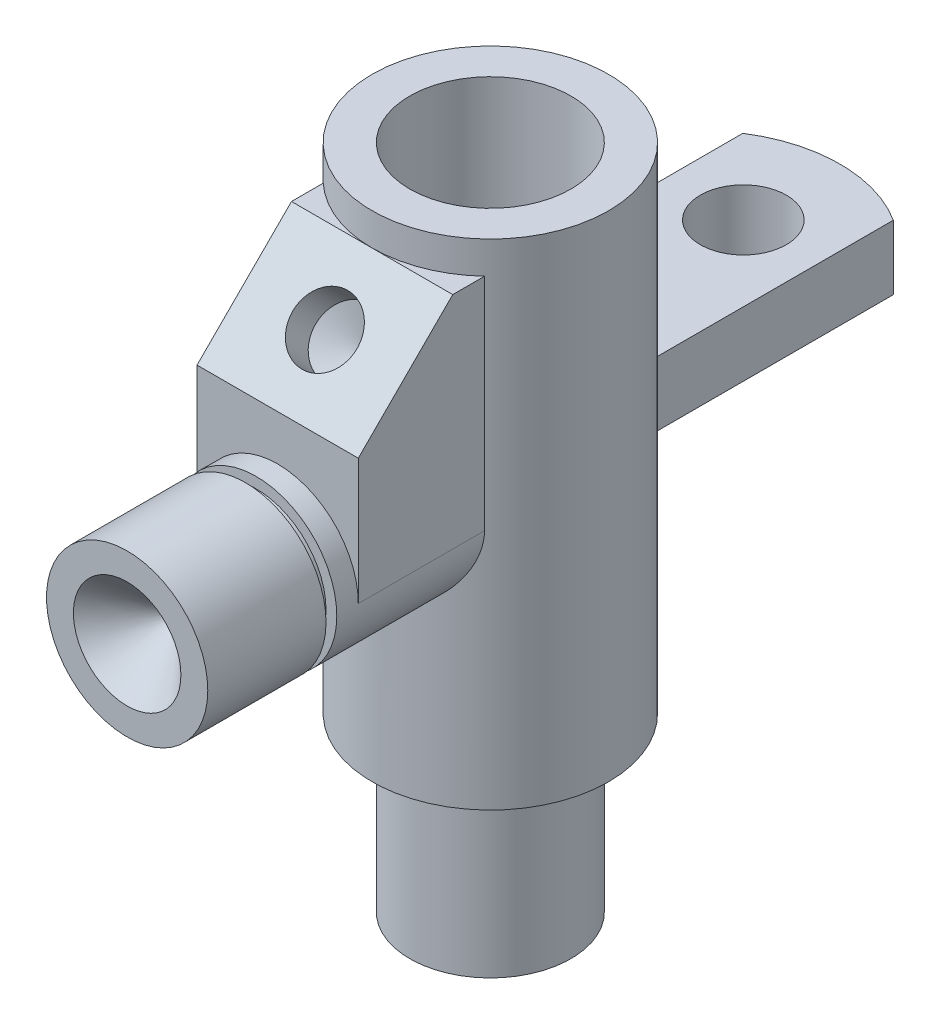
ISO-10303-21;
HEADER;
FILE_DESCRIPTION(('STEP AP214'),'2;1');
FILE_NAME('part.step','',(''),(''),'','','');
FILE_SCHEMA(('AUTOMOTIVE_DESIGN { 1 0 10303 214 1 1 1 1 }'));
ENDSEC;
DATA;
#1=APPLICATION_CONTEXT('core data for automotive mechanical design processes');
#2=APPLICATION_PROTOCOL_DEFINITION('international standard','automotive_design',2000,#1);
#3=PRODUCT_CONTEXT('',#1,'mechanical');
#4=PRODUCT('Part','Part','',(#3));
#5=PRODUCT_RELATED_PRODUCT_CATEGORY('part','',(#4));
#6=PRODUCT_DEFINITION_FORMATION('','',#4);
#7=PRODUCT_DEFINITION_CONTEXT('part definition',#1,'design');
#8=PRODUCT_DEFINITION('design','',#6,#7);
#9=PRODUCT_DEFINITION_SHAPE('','',#8);
#10=(LENGTH_UNIT() NAMED_UNIT(*) SI_UNIT(.MILLI.,.METRE.));
#11=(NAMED_UNIT(*) PLANE_ANGLE_UNIT() SI_UNIT($,.RADIAN.));
#12=(NAMED_UNIT(*) SI_UNIT($,.STERADIAN.) SOLID_ANGLE_UNIT());
#13=UNCERTAINTY_MEASURE_WITH_UNIT(LENGTH_MEASURE(1.E-05),#10,'distance_accuracy_value','');
#14=(GEOMETRIC_REPRESENTATION_CONTEXT(3) GLOBAL_UNCERTAINTY_ASSIGNED_CONTEXT((#13)) GLOBAL_UNIT_ASSIGNED_CONTEXT((#10,
#11,#12)) REPRESENTATION_CONTEXT('',''));
#15=CARTESIAN_POINT('',(0.,0.,0.));
#16=DIRECTION('',(0.,0.,1.));
#17=DIRECTION('',(1.,0.,0.));
#18=AXIS2_PLACEMENT_3D('',#15,#16,#17);
#19=CARTESIAN_POINT('',(0.,-23.4999999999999,33.7853437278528));
#20=DIRECTION('',(0.,0.,-1.));
#21=DIRECTION('',(-1.,0.,0.));
#22=AXIS2_PLACEMENT_3D('',#19,#20,#21);
#23=CYLINDRICAL_SURFACE('',#22,7.50000000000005);
#24=CARTESIAN_POINT('',(0.,-23.4999999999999,33.7853437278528));
#25=DIRECTION('',(0.,0.,1.));
#26=DIRECTION('',(1.,0.,0.));
#27=AXIS2_PLACEMENT_3D('',#24,#25,#26);
#28=CIRCLE('',#27,7.50000000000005);
#29=CARTESIAN_POINT('',(7.50000000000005,-23.4999999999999,33.7853437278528));
#30=VERTEX_POINT('',#29);
#31=EDGE_CURVE('E174',#30,#30,#28,.T.);
#32=ORIENTED_EDGE('',*,*,#31,.F.);
#33=EDGE_LOOP('',(#32));
#34=FACE_BOUND('',#33,.T.);
#35=CARTESIAN_POINT('',(0.,-23.4999999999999,22.7853437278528));
#36=DIRECTION('',(0.,0.,1.));
#37=DIRECTION('',(1.,0.,0.));
#38=AXIS2_PLACEMENT_3D('',#35,#36,#37);
#39=CIRCLE('',#38,7.50000000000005);
#40=CARTESIAN_POINT('',(7.50000000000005,-23.4999999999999,22.7853437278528));
#41=VERTEX_POINT('',#40);
#42=EDGE_CURVE('E352',#41,#41,#39,.T.);
#43=ORIENTED_EDGE('',*,*,#42,.T.);
#44=EDGE_LOOP('',(#43));
#45=FACE_BOUND('',#44,.T.);
#46=ADVANCED_FACE('F34',(#34,#45),#23,.T.);
#47=CARTESIAN_POINT('',(7.50000000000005,-23.4999999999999,8.04673846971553));
#48=CARTESIAN_POINT('',(7.50000742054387,-23.3182687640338,8.04672530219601));
#49=CARTESIAN_POINT('',(7.49338568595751,-23.1365946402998,8.05291697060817));
#50=CARTESIAN_POINT('',(7.46707104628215,-22.7749503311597,8.0773258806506));
#51=CARTESIAN_POINT('',(7.44737477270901,-22.5949805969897,8.09554622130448));
#52=CARTESIAN_POINT('',(7.39528588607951,-22.2381265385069,8.14315522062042));
#53=CARTESIAN_POINT('',(7.36287377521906,-22.0612473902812,8.17256102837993));
#54=CARTESIAN_POINT('',(7.28596109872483,-21.7120457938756,8.24120261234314));
#55=CARTESIAN_POINT('',(7.24145414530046,-21.5397258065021,8.2804435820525));
#56=CARTESIAN_POINT('',(7.09190328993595,-21.0348201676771,8.40964561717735));
#57=CARTESIAN_POINT('',(6.97019789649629,-20.710138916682,8.51170364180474));
#58=CARTESIAN_POINT('',(6.68698939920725,-20.0865365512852,8.73594069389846));
#59=CARTESIAN_POINT('',(6.52548063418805,-19.7876191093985,8.85812258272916));
#60=CARTESIAN_POINT('',(6.24121805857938,-19.3363867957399,9.05890076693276));
#61=CARTESIAN_POINT('',(6.13044105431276,-19.174973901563,9.13439393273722));
#62=CARTESIAN_POINT('',(5.89695423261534,-18.8616694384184,9.28683736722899));
#63=CARTESIAN_POINT('',(5.77424249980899,-18.7097794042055,9.36378786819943));
#64=CARTESIAN_POINT('',(5.51716141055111,-18.4157992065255,9.51753088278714));
#65=CARTESIAN_POINT('',(5.3827797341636,-18.2737196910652,9.59432313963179));
#66=CARTESIAN_POINT('',(5.10280782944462,-18.0000296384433,9.74611257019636));
#67=CARTESIAN_POINT('',(4.95721767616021,-17.8684190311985,9.82110975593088));
#68=CARTESIAN_POINT('',(4.63178673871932,-17.5967676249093,9.97918483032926));
#69=CARTESIAN_POINT('',(4.45013152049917,-17.4585719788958,10.0617181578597));
#70=CARTESIAN_POINT('',(4.0729583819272,-17.1981327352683,10.22021810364));
#71=CARTESIAN_POINT('',(3.87743809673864,-17.0758918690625,10.2961835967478));
#72=CARTESIAN_POINT('',(3.4737971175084,-16.8489660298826,10.4392773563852));
#73=CARTESIAN_POINT('',(3.26569613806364,-16.744254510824,10.5064189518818));
#74=CARTESIAN_POINT('',(2.83798788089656,-16.5537368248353,10.6299251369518));
#75=CARTESIAN_POINT('',(2.61838531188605,-16.4679229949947,10.6862940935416));
#76=CARTESIAN_POINT('',(2.22740000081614,-16.3362298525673,10.7734788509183));
#77=CARTESIAN_POINT('',(2.05818151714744,-16.2857587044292,10.8071359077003));
#78=CARTESIAN_POINT('',(1.71535183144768,-16.1966503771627,10.8668218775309));
#79=CARTESIAN_POINT('',(1.54174152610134,-16.1580108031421,10.8928523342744));
#80=CARTESIAN_POINT('',(1.19131352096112,-16.0930770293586,10.9367241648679));
#81=CARTESIAN_POINT('',(1.01449783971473,-16.0667753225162,10.9545705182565));
#82=CARTESIAN_POINT('',(0.658777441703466,-16.0268451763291,10.9817042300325));
#83=CARTESIAN_POINT('',(0.479872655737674,-16.013217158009,10.9909913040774));
#84=CARTESIAN_POINT('',(0.120993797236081,-15.9988223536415,11.0008017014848));
#85=CARTESIAN_POINT('',(-0.0589815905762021,-15.9980778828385,11.0013098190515));
#86=CARTESIAN_POINT('',(-0.41832669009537,-16.009518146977,10.993511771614));
#87=CARTESIAN_POINT('',(-0.597696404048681,-16.0217028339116,10.9852056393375));
#88=CARTESIAN_POINT('',(-0.954536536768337,-16.0588275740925,10.9599663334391));
#89=CARTESIAN_POINT('',(-1.13200648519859,-16.0837707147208,10.9430310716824));
#90=CARTESIAN_POINT('',(-1.48375078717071,-16.1460629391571,10.9009111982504));
#91=CARTESIAN_POINT('',(-1.65802513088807,-16.183412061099,10.8757265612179));
#92=CARTESIAN_POINT('',(-1.99895231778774,-16.2691989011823,10.8182017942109));
#93=CARTESIAN_POINT('',(-2.16568728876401,-16.3174094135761,10.786008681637));
#94=CARTESIAN_POINT('',(-2.49413880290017,-16.4247499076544,10.7148289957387));
#95=CARTESIAN_POINT('',(-2.65585355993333,-16.4838837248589,10.6758400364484));
#96=CARTESIAN_POINT('',(-3.13218456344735,-16.6767609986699,10.549741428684));
#97=CARTESIAN_POINT('',(-3.43824311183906,-16.8260456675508,10.4534553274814));
#98=CARTESIAN_POINT('',(-4.05554880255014,-17.1799334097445,10.2309435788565));
#99=CARTESIAN_POINT('',(-4.36349377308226,-17.3888746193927,10.1025667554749));
#100=CARTESIAN_POINT('',(-4.94217379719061,-17.8465790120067,9.83244142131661));
#101=CARTESIAN_POINT('',(-5.21286556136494,-18.0953878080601,9.69067767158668));
#102=CARTESIAN_POINT('',(-5.61022177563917,-18.5179018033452,9.46330260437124));
#103=CARTESIAN_POINT('',(-5.7500886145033,-18.680006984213,9.37876440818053));
#104=CARTESIAN_POINT('',(-6.01573852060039,-19.0159448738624,9.21062266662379));
#105=CARTESIAN_POINT('',(-6.1415187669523,-19.1897799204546,9.1270193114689));
#106=CARTESIAN_POINT('',(-6.37830094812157,-19.5486152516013,8.96314692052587));
#107=CARTESIAN_POINT('',(-6.48931018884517,-19.7336099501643,8.88287624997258));
#108=CARTESIAN_POINT('',(-6.69584748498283,-20.1143541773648,8.72824572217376));
#109=CARTESIAN_POINT('',(-6.79137502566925,-20.3101040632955,8.65388606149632));
#110=CARTESIAN_POINT('',(-7.011962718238,-20.8178464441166,8.47711906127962));
#111=CARTESIAN_POINT('',(-7.12615562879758,-21.1368596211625,8.38051182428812));
#112=CARTESIAN_POINT('',(-7.26511288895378,-21.6298844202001,8.25965517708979));
#113=CARTESIAN_POINT('',(-7.30603474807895,-21.7965835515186,8.2233870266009));
#114=CARTESIAN_POINT('',(-7.37657878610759,-22.1340745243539,8.16016752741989));
#115=CARTESIAN_POINT('',(-7.40620602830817,-22.3048644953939,8.13321200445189));
#116=CARTESIAN_POINT('',(-7.45384995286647,-22.6509391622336,8.08957248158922));
#117=CARTESIAN_POINT('',(-7.4717610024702,-22.8262503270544,8.07298199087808));
#118=CARTESIAN_POINT('',(-7.49517957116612,-23.1784156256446,8.05124480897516));
#119=CARTESIAN_POINT('',(-7.50068736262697,-23.3552697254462,8.04609786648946));
#120=CARTESIAN_POINT('',(-7.49917549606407,-23.7088724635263,8.04750689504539));
#121=CARTESIAN_POINT('',(-7.4921560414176,-23.8856211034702,8.05406267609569));
#122=CARTESIAN_POINT('',(-7.46574696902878,-24.2373826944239,8.07854832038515));
#123=CARTESIAN_POINT('',(-7.44635764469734,-24.412395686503,8.09647791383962));
#124=CARTESIAN_POINT('',(-7.39857467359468,-24.738976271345,8.14014747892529));
#125=CARTESIAN_POINT('',(-7.37149679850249,-24.8908952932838,8.16473099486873));
#126=CARTESIAN_POINT('',(-7.30838743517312,-25.1914737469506,8.22126909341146));
#127=CARTESIAN_POINT('',(-7.27235336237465,-25.3401322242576,8.25322580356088));
#128=CARTESIAN_POINT('',(-7.15138578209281,-25.7804041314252,8.3587765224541));
#129=CARTESIAN_POINT('',(-7.05358931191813,-26.066298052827,8.44204881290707));
#130=CARTESIAN_POINT('',(-6.85796948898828,-26.543961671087,8.60113508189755));
#131=CARTESIAN_POINT('',(-6.76736797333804,-26.7402056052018,8.67283172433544));
#132=CARTESIAN_POINT('',(-6.57078441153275,-27.122278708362,8.82270173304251));
#133=CARTESIAN_POINT('',(-6.46480163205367,-27.3081073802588,8.90087540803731));
#134=CARTESIAN_POINT('',(-6.23807093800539,-27.6691746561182,9.0612243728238));
#135=CARTESIAN_POINT('',(-6.11729730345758,-27.8443939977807,9.14340647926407));
#136=CARTESIAN_POINT('',(-5.8617430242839,-28.1834846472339,9.3093058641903));
#137=CARTESIAN_POINT('',(-5.7269639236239,-28.347357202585,9.39302297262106));
#138=CARTESIAN_POINT('',(-5.44178313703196,-28.6655893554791,9.56110836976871));
#139=CARTESIAN_POINT('',(-5.29118129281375,-28.8197741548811,9.64546819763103));
#140=CARTESIAN_POINT('',(-4.9764630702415,-29.1152831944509,9.8115479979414));
#141=CARTESIAN_POINT('',(-4.81234569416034,-29.256606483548,9.89326777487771));
#142=CARTESIAN_POINT('',(-4.47132899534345,-29.5253027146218,10.0519919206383));
#143=CARTESIAN_POINT('',(-4.2944474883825,-29.652694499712,10.1290025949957));
#144=CARTESIAN_POINT('',(-3.9283508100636,-29.8926467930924,10.2765257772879));
#145=CARTESIAN_POINT('',(-3.73913825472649,-30.0052104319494,10.3470396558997));
#146=CARTESIAN_POINT('',(-3.38327024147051,-30.1960312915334,10.4681610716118));
#147=CARTESIAN_POINT('',(-3.21843506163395,-30.2768479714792,10.5200956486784));
#148=CARTESIAN_POINT('',(-2.88163603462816,-30.4267695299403,10.6172914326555));
#149=CARTESIAN_POINT('',(-2.70967349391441,-30.4958765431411,10.662553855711));
#150=CARTESIAN_POINT('',(-2.35953064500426,-30.6216009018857,10.7454626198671));
#151=CARTESIAN_POINT('',(-2.18135297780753,-30.6782234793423,10.7831121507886));
#152=CARTESIAN_POINT('',(-1.81977417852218,-30.7782969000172,10.8499870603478));
#153=CARTESIAN_POINT('',(-1.63637298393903,-30.8217475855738,10.8792123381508));
#154=CARTESIAN_POINT('',(-1.26469193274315,-30.8950395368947,10.9286720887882));
#155=CARTESIAN_POINT('',(-1.07639219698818,-30.9248113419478,10.94886066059));
#156=CARTESIAN_POINT('',(-0.69728263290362,-30.9699554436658,10.9795245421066));
#157=CARTESIAN_POINT('',(-0.506472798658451,-30.9853277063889,10.9899998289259));
#158=CARTESIAN_POINT('',(-0.123983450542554,-31.0014172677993,11.0009647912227));
#159=CARTESIAN_POINT('',(0.0676958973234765,-31.0021372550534,11.0014562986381));
#160=CARTESIAN_POINT('',(0.450303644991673,-30.988915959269,10.9924445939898));
#161=CARTESIAN_POINT('',(0.641232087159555,-30.9749755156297,10.982941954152));
#162=CARTESIAN_POINT('',(1.00491839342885,-30.9344322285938,10.9553906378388));
#163=CARTESIAN_POINT('',(1.17786562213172,-30.9089802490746,10.9381193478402));
#164=CARTESIAN_POINT('',(1.5206913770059,-30.8462828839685,10.895748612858));
#165=CARTESIAN_POINT('',(1.69056884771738,-30.8090335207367,10.8706465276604));
#166=CARTESIAN_POINT('',(2.02611793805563,-30.7232147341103,10.8131317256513));
#167=CARTESIAN_POINT('',(2.1917905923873,-30.6746481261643,10.7807208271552));
#168=CARTESIAN_POINT('',(2.51815043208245,-30.5667161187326,10.7091943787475));
#169=CARTESIAN_POINT('',(2.67883567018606,-30.5073465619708,10.6700762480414));
#170=CARTESIAN_POINT('',(3.0020631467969,-30.3752848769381,10.5838045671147));
#171=CARTESIAN_POINT('',(3.16431991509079,-30.3020876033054,10.5363540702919));
#172=CARTESIAN_POINT('',(3.48183203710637,-30.1451672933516,10.4357384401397));
#173=CARTESIAN_POINT('',(3.63708482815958,-30.0614404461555,10.3825712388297));
#174=CARTESIAN_POINT('',(4.09148916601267,-29.795455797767,10.2158484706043));
#175=CARTESIAN_POINT('',(4.37950272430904,-29.5983045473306,10.0950121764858));
#176=CARTESIAN_POINT('',(4.80783845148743,-29.2597639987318,9.89519547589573));
#177=CARTESIAN_POINT('',(4.95930747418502,-29.1298229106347,9.8200004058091));
#178=CARTESIAN_POINT('',(5.2508643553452,-28.8589163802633,9.66723621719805));
#179=CARTESIAN_POINT('',(5.39095103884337,-28.7179498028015,9.58966685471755));
#180=CARTESIAN_POINT('',(5.65960756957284,-28.425282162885,9.43361242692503));
#181=CARTESIAN_POINT('',(5.78815170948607,-28.27355842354,9.35512573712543));
#182=CARTESIAN_POINT('',(6.03301431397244,-27.9600775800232,9.19911997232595));
#183=CARTESIAN_POINT('',(6.14933277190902,-27.798320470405,9.12160089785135));
#184=CARTESIAN_POINT('',(6.3841231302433,-27.4426266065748,8.95912934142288));
#185=CARTESIAN_POINT('',(6.50077022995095,-27.2472919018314,8.87458411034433));
#186=CARTESIAN_POINT('',(6.71685529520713,-26.8445608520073,8.71218294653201));
#187=CARTESIAN_POINT('',(6.81628823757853,-26.6371610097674,8.6343289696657));
#188=CARTESIAN_POINT('',(6.99639145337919,-26.2117603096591,8.48904335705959));
#189=CARTESIAN_POINT('',(7.0771276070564,-25.9938000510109,8.42157541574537));
#190=CARTESIAN_POINT('',(7.21875993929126,-25.5479616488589,8.30049381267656));
#191=CARTESIAN_POINT('',(7.27967366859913,-25.3200924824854,8.24686790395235));
#192=CARTESIAN_POINT('',(7.38576112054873,-24.8304161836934,8.15206780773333));
#193=CARTESIAN_POINT('',(7.42843287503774,-24.5676519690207,8.11294007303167));
#194=CARTESIAN_POINT('',(7.48553850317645,-24.0365481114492,8.06029268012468));
#195=CARTESIAN_POINT('',(7.49998904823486,-23.7682118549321,8.04675790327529));
#196=CARTESIAN_POINT('',(7.50000000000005,-23.4999999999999,8.04673846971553));
#197=B_SPLINE_CURVE_WITH_KNOTS('',3,(#47,#48,#49,#50,#51,#52,#53,#54,#55,#56,#57,#58,#59,#60,
#61,#62,#63,#64,#65,#66,#67,#68,#69,#70,#71,#72,#73,#74,#75,#76,#77,#78,#79,#80,#81,#82,#83,#84,
#85,#86,#87,#88,#89,#90,#91,#92,#93,#94,#95,#96,#97,#98,#99,#100,#101,#102,#103,#104,#105,#106,
#107,#108,#109,#110,#111,#112,#113,#114,#115,#116,#117,#118,#119,#120,#121,#122,#123,#124,#125,
#126,#127,#128,#129,#130,#131,#132,#133,#134,#135,#136,#137,#138,#139,#140,#141,#142,#143,#144,
#145,#146,#147,#148,#149,#150,#151,#152,#153,#154,#155,#156,#157,#158,#159,#160,#161,#162,#163,
#164,#165,#166,#167,#168,#169,#170,#171,#172,#173,#174,#175,#176,#177,#178,#179,#180,#181,#182,
#183,#184,#185,#186,#187,#188,#189,#190,#191,#192,#193,#194,#195,#196),.UNSPECIFIED.,.T.,.F.,(4,
2,2,2,2,2,2,2,2,2,2,2,2,2,2,2,2,2,2,2,2,2,2,2,2,2,2,2,2,2,2,2,2,2,2,2,2,2,2,2,2,2,2,2,2,2,2,2,2,
2,2,2,2,2,2,2,2,2,2,2,2,2,2,2,2,2,2,2,2,2,2,2,2,2,4),(0.,0.544873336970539,1.08988710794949,
1.63573986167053,2.1818814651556,3.26160195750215,4.34147610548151,4.9704464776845,
5.59951795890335,6.22926181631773,6.85900145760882,7.58615376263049,8.31343039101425,
9.03959548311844,9.76546557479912,10.3042023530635,10.8428300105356,11.3811295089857,
11.9194468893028,12.4586965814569,12.9979442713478,13.537322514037,14.0767024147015,
14.6057031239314,15.1348899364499,16.1924693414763,17.3692311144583,18.5473489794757,
19.2372937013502,19.9273763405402,20.6171163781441,21.3068793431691,22.3591777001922,
22.8849644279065,23.4105151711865,23.94074123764,24.4709556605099,25.0011614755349,
25.5313547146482,25.9996388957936,26.468058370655,27.4049458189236,28.0873671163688,
28.769820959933,29.4534788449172,30.1370614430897,30.8306710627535,31.524331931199,
32.2170426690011,32.9096069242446,33.4813996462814,34.053088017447,34.6245363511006,
35.1959915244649,35.770317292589,36.3446444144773,36.9188661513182,37.4930550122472,
38.019438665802,38.5459999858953,39.0724304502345,39.5990639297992,40.1511454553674,
40.7034273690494,41.8072741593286,42.4465946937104,43.0859811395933,43.726758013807,
44.367535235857,45.0947211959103,45.8221189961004,46.5469133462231,47.2710642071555,
48.0757024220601,48.8798651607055),.UNSPECIFIED.);
#198=CARTESIAN_POINT('',(-7.50000000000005,-23.4999999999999,8.04673846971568));
#199=VERTEX_POINT('',#198);
#200=CARTESIAN_POINT('',(7.49999999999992,-23.5,8.04673846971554));
#201=VERTEX_POINT('',#200);
#202=EDGE_CURVE('E166',#199,#201,#197,.T.);
#203=ORIENTED_EDGE('',*,*,#202,.T.);
#204=DIRECTION('',(0.,0.,1.));
#205=VECTOR('',#204,1.);
#206=CARTESIAN_POINT('',(7.49999999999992,-23.5,8.04673846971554));
#207=LINE('',#206,#205);
#208=CARTESIAN_POINT('',(7.49999999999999,-23.5,19.7853437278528));
#209=VERTEX_POINT('',#208);
#210=EDGE_CURVE('E381',#201,#209,#207,.T.);
#211=ORIENTED_EDGE('',*,*,#210,.T.);
#212=CARTESIAN_POINT('',(0.,-23.4999999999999,19.7853437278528));
#213=DIRECTION('',(0.,0.,1.));
#214=DIRECTION('',(1.,0.,0.));
#215=AXIS2_PLACEMENT_3D('',#212,#213,#214);
#216=CIRCLE('',#215,7.50000000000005);
#217=CARTESIAN_POINT('',(-7.50000000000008,-23.4999999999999,19.7853437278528));
#218=VERTEX_POINT('',#217);
#219=EDGE_CURVE('E410',#218,#209,#216,.F.);
#220=ORIENTED_EDGE('',*,*,#219,.F.);
#221=DIRECTION('',(0.,0.,-1.));
#222=VECTOR('',#221,1.);
#223=CARTESIAN_POINT('',(-7.50000000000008,-23.4999999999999,8.04673846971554));
#224=LINE('',#223,#222);
#225=EDGE_CURVE('E378',#218,#199,#224,.T.);
#226=ORIENTED_EDGE('',*,*,#225,.T.);
#227=EDGE_LOOP('',(#203,#211,#220,#226));
#228=FACE_BOUND('',#227,.T.);
#229=CARTESIAN_POINT('',(0.,-23.4999999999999,21.7853437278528));
#230=DIRECTION('',(0.,0.,1.));
#231=DIRECTION('',(1.,0.,0.));
#232=AXIS2_PLACEMENT_3D('',#229,#230,#231);
#233=CIRCLE('',#232,7.50000000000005);
#234=CARTESIAN_POINT('',(7.50000000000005,-23.4999999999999,21.7853437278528));
#235=VERTEX_POINT('',#234);
#236=EDGE_CURVE('E350',#235,#235,#233,.T.);
#237=ORIENTED_EDGE('',*,*,#236,.F.);
#238=EDGE_LOOP('',(#237));
#239=FACE_BOUND('',#238,.T.);
#240=ADVANCED_FACE('F257',(#228,#239),#23,.T.);
#241=CARTESIAN_POINT('',(-11.0000000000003,-2.99999999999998,11.0000000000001));
#242=DIRECTION('',(0.,-0.707106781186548,-0.707106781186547));
#243=DIRECTION('',(0.,0.707106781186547,-0.707106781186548));
#244=AXIS2_PLACEMENT_3D('',#241,#242,#243);
#245=PLANE('',#244);
#246=DIRECTION('',(0.,0.707106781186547,-0.707106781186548));
#247=VECTOR('',#246,1.);
#248=CARTESIAN_POINT('',(7.49999999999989,-32.5469564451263,40.5469564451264));
#249=LINE('',#248,#247);
#250=CARTESIAN_POINT('',(7.49999999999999,-11.7853437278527,19.7853437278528));
#251=VERTEX_POINT('',#250);
#252=CARTESIAN_POINT('',(7.49999999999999,-2.99999999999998,11.0000000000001));
#253=VERTEX_POINT('',#252);
#254=EDGE_CURVE('E405',#251,#253,#249,.T.);
#255=ORIENTED_EDGE('',*,*,#254,.T.);
#256=DIRECTION('',(-1.,0.,0.));
#257=VECTOR('',#256,1.);
#258=CARTESIAN_POINT('',(0.,-2.99999999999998,11.0000000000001));
#259=LINE('',#258,#257);
#260=CARTESIAN_POINT('',(0.,-2.99999999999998,11.0000000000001));
#261=VERTEX_POINT('',#260);
#262=EDGE_CURVE('E12',#253,#261,#259,.T.);
#263=ORIENTED_EDGE('',*,*,#262,.T.);
#264=CARTESIAN_POINT('',(-7.50000000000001,-2.99999999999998,11.0000000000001));
#265=VERTEX_POINT('',#264);
#266=EDGE_CURVE('E48',#261,#265,#259,.T.);
#267=ORIENTED_EDGE('',*,*,#266,.T.);
#268=DIRECTION('',(0.,-0.707106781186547,0.707106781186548));
#269=VECTOR('',#268,1.);
#270=CARTESIAN_POINT('',(-7.50000000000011,-32.5469564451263,40.5469564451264));
#271=LINE('',#270,#269);
#272=CARTESIAN_POINT('',(-7.50000000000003,-11.7853437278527,19.7853437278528));
#273=VERTEX_POINT('',#272);
#274=EDGE_CURVE('E407',#265,#273,#271,.T.);
#275=ORIENTED_EDGE('',*,*,#274,.T.);
#276=DIRECTION('',(1.,0.,0.));
#277=VECTOR('',#276,1.);
#278=CARTESIAN_POINT('',(-11.0000000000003,-11.7853437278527,19.7853437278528));
#279=LINE('',#278,#277);
#280=EDGE_CURVE('E409',#273,#251,#279,.T.);
#281=ORIENTED_EDGE('',*,*,#280,.T.);
#282=EDGE_LOOP('',(#255,#263,#267,#275,#281));
#283=FACE_BOUND('',#282,.T.);
#284=CARTESIAN_POINT('',(0.,-7.39267186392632,15.3926718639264));
#285=DIRECTION('',(0.,0.707106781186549,0.707106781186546));
#286=DIRECTION('',(0.,-0.707106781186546,0.707106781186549));
#287=AXIS2_PLACEMENT_3D('',#284,#285,#286);
#288=CIRCLE('',#287,3.);
#289=CARTESIAN_POINT('',(0.,-9.51399220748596,17.5139922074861));
#290=VERTEX_POINT('',#289);
#291=EDGE_CURVE('E341',#290,#290,#288,.T.);
#292=ORIENTED_EDGE('',*,*,#291,.F.);
#293=EDGE_LOOP('',(#292));
#294=FACE_BOUND('',#293,.T.);
#295=ADVANCED_FACE('F207',(#283,#294),#245,.F.);
#296=CARTESIAN_POINT('',(0.,0.,0.));
#297=DIRECTION('',(0.,1.,0.));
#298=DIRECTION('',(0.,0.,1.));
#299=AXIS2_PLACEMENT_3D('',#296,#297,#298);
#300=CYLINDRICAL_SURFACE('',#299,7.5);
#301=CARTESIAN_POINT('',(0.,-16.25,0.));
#302=DIRECTION('',(0.,1.,0.));
#303=DIRECTION('',(0.,0.,1.));
#304=AXIS2_PLACEMENT_3D('',#301,#302,#303);
#305=CIRCLE('',#304,7.5);
#306=CARTESIAN_POINT('',(0.,-16.25,7.5));
#307=VERTEX_POINT('',#306);
#308=EDGE_CURVE('E146',#307,#307,#305,.T.);
#309=ORIENTED_EDGE('',*,*,#308,.F.);
#310=EDGE_LOOP('',(#309));
#311=FACE_BOUND('',#310,.T.);
#312=CARTESIAN_POINT('',(0.,0.,0.));
#313=DIRECTION('',(0.,1.,0.));
#314=DIRECTION('',(0.,0.,1.));
#315=AXIS2_PLACEMENT_3D('',#312,#313,#314);
#316=CIRCLE('',#315,7.5);
#317=CARTESIAN_POINT('',(0.,0.,7.5));
#318=VERTEX_POINT('',#317);
#319=EDGE_CURVE('E143',#318,#318,#316,.T.);
#320=ORIENTED_EDGE('',*,*,#319,.T.);
#321=EDGE_LOOP('',(#320));
#322=FACE_BOUND('',#321,.T.);
#323=CARTESIAN_POINT('',(0.,-16.169227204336,7.5));
#324=CARTESIAN_POINT('',(0.0287511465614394,-16.1692289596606,7.50000017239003));
#325=CARTESIAN_POINT('',(0.057494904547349,-16.1665711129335,7.49983286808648));
#326=CARTESIAN_POINT('',(0.114028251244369,-16.1561423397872,7.49918642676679));
#327=CARTESIAN_POINT('',(0.141817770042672,-16.1483710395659,7.49870726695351));
#328=CARTESIAN_POINT('',(0.19551891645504,-16.1282875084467,7.49749905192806));
#329=CARTESIAN_POINT('',(0.221439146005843,-16.1159979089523,7.49677124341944));
#330=CARTESIAN_POINT('',(0.271045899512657,-16.0875585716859,7.49514185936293));
#331=CARTESIAN_POINT('',(0.294731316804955,-16.0714069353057,7.4942401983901));
#332=CARTESIAN_POINT('',(0.347196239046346,-16.0299295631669,7.49201976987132));
#333=CARTESIAN_POINT('',(0.374982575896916,-16.0033496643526,7.49066318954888));
#334=CARTESIAN_POINT('',(0.425869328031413,-15.9460352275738,7.48794276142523));
#335=CARTESIAN_POINT('',(0.448961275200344,-15.9152933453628,7.48657890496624));
#336=CARTESIAN_POINT('',(0.49761194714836,-15.8399429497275,7.48352637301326));
#337=CARTESIAN_POINT('',(0.521357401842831,-15.7941642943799,7.48188412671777));
#338=CARTESIAN_POINT('',(0.561218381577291,-15.6994154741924,7.47899919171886));
#339=CARTESIAN_POINT('',(0.577323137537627,-15.6504409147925,7.47775706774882));
#340=CARTESIAN_POINT('',(0.60616729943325,-15.5361712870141,7.47548230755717));
#341=CARTESIAN_POINT('',(0.616557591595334,-15.4702799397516,7.47461625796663));
#342=CARTESIAN_POINT('',(0.62652951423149,-15.3376631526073,7.47378614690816));
#343=CARTESIAN_POINT('',(0.626097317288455,-15.2709367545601,7.47382323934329));
#344=CARTESIAN_POINT('',(0.614749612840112,-15.1376243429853,7.47476528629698));
#345=CARTESIAN_POINT('',(0.60371486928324,-15.0710485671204,7.47568011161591));
#346=CARTESIAN_POINT('',(0.570792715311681,-14.9406597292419,7.4782669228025));
#347=CARTESIAN_POINT('',(0.548922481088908,-14.8768424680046,7.4799377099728));
#348=CARTESIAN_POINT('',(0.502787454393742,-14.7750462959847,7.48315024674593));
#349=CARTESIAN_POINT('',(0.481783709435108,-14.7355778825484,7.48454745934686));
#350=CARTESIAN_POINT('',(0.434169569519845,-14.6601636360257,7.48746074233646));
#351=CARTESIAN_POINT('',(0.407568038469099,-14.6242123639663,7.48897662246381));
#352=CARTESIAN_POINT('',(0.356201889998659,-14.5664640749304,7.49156806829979));
#353=CARTESIAN_POINT('',(0.332820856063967,-14.5434417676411,7.49265379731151));
#354=CARTESIAN_POINT('',(0.282736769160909,-14.5013178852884,7.49471050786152));
#355=CARTESIAN_POINT('',(0.256038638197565,-14.4822106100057,7.49568165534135));
#356=CARTESIAN_POINT('',(0.205440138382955,-14.452665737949,7.49721907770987));
#357=CARTESIAN_POINT('',(0.182114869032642,-14.4412513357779,7.49782755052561));
#358=CARTESIAN_POINT('',(0.133890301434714,-14.4224197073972,7.49884343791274));
#359=CARTESIAN_POINT('',(0.108992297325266,-14.414999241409,7.49925101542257));
#360=CARTESIAN_POINT('',(0.0580955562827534,-14.4047160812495,7.4998183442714));
#361=CARTESIAN_POINT('',(0.0320910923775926,-14.4018811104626,7.49997658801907));
#362=CARTESIAN_POINT('',(-0.0199883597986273,-14.4011271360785,7.50001852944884));
#363=CARTESIAN_POINT('',(-0.0460633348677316,-14.4032072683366,7.49990227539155));
#364=CARTESIAN_POINT('',(-0.0949853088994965,-14.4116633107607,7.4994347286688));
#365=CARTESIAN_POINT('',(-0.117906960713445,-14.417621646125,7.49910630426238));
#366=CARTESIAN_POINT('',(-0.162548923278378,-14.4329897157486,7.49827161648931));
#367=CARTESIAN_POINT('',(-0.184268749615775,-14.4424008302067,7.49776528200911));
#368=CARTESIAN_POINT('',(-0.233914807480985,-14.4681682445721,7.4964063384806));
#369=CARTESIAN_POINT('',(-0.261173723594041,-14.4858058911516,7.49549489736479));
#370=CARTESIAN_POINT('',(-0.312486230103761,-14.5252410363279,7.49353156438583));
#371=CARTESIAN_POINT('',(-0.336533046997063,-14.5470470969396,7.49247938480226));
#372=CARTESIAN_POINT('',(-0.390818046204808,-14.603511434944,7.48987862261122));
#373=CARTESIAN_POINT('',(-0.419429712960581,-14.6397268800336,7.48830674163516));
#374=CARTESIAN_POINT('',(-0.47062028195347,-14.7161721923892,7.48526367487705));
#375=CARTESIAN_POINT('',(-0.493187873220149,-14.7564093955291,7.4837926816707));
#376=CARTESIAN_POINT('',(-0.540545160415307,-14.8558738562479,7.48054698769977));
#377=CARTESIAN_POINT('',(-0.562722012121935,-14.9163491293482,7.47888015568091));
#378=CARTESIAN_POINT('',(-0.59712084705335,-15.0400585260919,7.47621143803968));
#379=CARTESIAN_POINT('',(-0.609332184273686,-15.1032955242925,7.47521026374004));
#380=CARTESIAN_POINT('',(-0.624190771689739,-15.232113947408,7.47398440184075));
#381=CARTESIAN_POINT('',(-0.62665117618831,-15.2977170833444,7.47377488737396));
#382=CARTESIAN_POINT('',(-0.621203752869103,-15.4284840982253,7.47423026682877));
#383=CARTESIAN_POINT('',(-0.613304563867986,-15.49364829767,7.47489443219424));
#384=CARTESIAN_POINT('',(-0.589062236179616,-15.6088466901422,7.47683871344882));
#385=CARTESIAN_POINT('',(-0.574719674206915,-15.6593042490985,7.4779693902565));
#386=CARTESIAN_POINT('',(-0.538291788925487,-15.75735188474,7.48068046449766));
#387=CARTESIAN_POINT('',(-0.516217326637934,-15.8049458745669,7.48226023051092));
#388=CARTESIAN_POINT('',(-0.470367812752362,-15.883821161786,7.48526118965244));
#389=CARTESIAN_POINT('',(-0.448443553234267,-15.9161785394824,7.48662100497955));
#390=CARTESIAN_POINT('',(-0.399746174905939,-15.9770267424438,7.48937893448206));
#391=CARTESIAN_POINT('',(-0.372979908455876,-16.0055229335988,7.49077699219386));
#392=CARTESIAN_POINT('',(-0.32054485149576,-16.0519680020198,7.49318306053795));
#393=CARTESIAN_POINT('',(-0.295738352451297,-16.0708854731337,7.49421296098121));
#394=CARTESIAN_POINT('',(-0.243339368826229,-16.1044184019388,7.49609708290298));
#395=CARTESIAN_POINT('',(-0.215747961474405,-16.1190355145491,7.49695137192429));
#396=CARTESIAN_POINT('',(-0.157502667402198,-16.1434151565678,7.498404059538));
#397=CARTESIAN_POINT('',(-0.126782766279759,-16.1530230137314,7.49899423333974));
#398=CARTESIAN_POINT('',(-0.0640381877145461,-16.1659256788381,7.49979196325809));
#399=CARTESIAN_POINT('',(-0.0320145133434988,-16.1692252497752,7.49999980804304));
#400=CARTESIAN_POINT('',(0.,-16.169227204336,7.5));
#401=B_SPLINE_CURVE_WITH_KNOTS('',3,(#323,#324,#325,#326,#327,#328,#329,#330,#331,#332,#333,
#334,#335,#336,#337,#338,#339,#340,#341,#342,#343,#344,#345,#346,#347,#348,#349,#350,#351,#352,
#353,#354,#355,#356,#357,#358,#359,#360,#361,#362,#363,#364,#365,#366,#367,#368,#369,#370,#371,
#372,#373,#374,#375,#376,#377,#378,#379,#380,#381,#382,#383,#384,#385,#386,#387,#388,#389,#390,
#391,#392,#393,#394,#395,#396,#397,#398,#399,#400),.UNSPECIFIED.,.T.,.F.,(4,2,2,2,2,2,2,2,2,2,2,
2,2,2,2,2,2,2,2,2,2,2,2,2,2,2,2,2,2,2,2,2,2,2,2,2,2,2,4),(0.,0.0861223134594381,
0.172250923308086,0.257953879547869,0.34369905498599,0.458497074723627,0.573500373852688,
0.727452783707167,0.881621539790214,1.08072634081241,1.28008554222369,1.48171329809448,
1.68302245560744,1.81684011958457,1.95044746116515,2.04862409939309,2.14665676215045,
2.22427545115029,2.30183108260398,2.3798538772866,2.45786295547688,2.52861591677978,
2.59939719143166,2.69629737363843,2.79339877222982,2.93117880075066,3.06921489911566,
3.26150442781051,3.4539991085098,3.6501650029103,3.8461674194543,4.00303998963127,
4.15969307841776,4.2766207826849,4.39338428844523,4.48666020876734,4.57990018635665,
4.67587020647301,4.77176773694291),.UNSPECIFIED.);
#402=CARTESIAN_POINT('',(0.,-16.169227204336,7.5));
#403=VERTEX_POINT('',#402);
#404=EDGE_CURVE('E38',#403,#403,#401,.T.);
#405=ORIENTED_EDGE('',*,*,#404,.T.);
#406=EDGE_LOOP('',(#405));
#407=FACE_BOUND('',#406,.T.);
#408=ADVANCED_FACE('F203',(#311,#322,#407),#300,.F.);
#409=CARTESIAN_POINT('',(0.,0.,0.));
#410=DIRECTION('',(0.,1.,0.));
#411=DIRECTION('',(-1.,0.,0.));
#412=AXIS2_PLACEMENT_3D('',#409,#410,#411);
#413=CYLINDRICAL_SURFACE('',#412,11.0000000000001);
#414=ORIENTED_EDGE('',*,*,#202,.F.);
#415=DIRECTION('',(0.,1.,0.));
#416=VECTOR('',#415,1.);
#417=CARTESIAN_POINT('',(-7.50000000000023,-65.0471744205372,8.04673846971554));
#418=LINE('',#417,#416);
#419=CARTESIAN_POINT('',(-7.50000000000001,-2.99999999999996,8.04673846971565));
#420=VERTEX_POINT('',#419);
#421=EDGE_CURVE('E382',#199,#420,#418,.T.);
#422=ORIENTED_EDGE('',*,*,#421,.T.);
#423=CARTESIAN_POINT('',(0.,-2.99999999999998,0.));
#424=DIRECTION('',(0.,-1.,0.));
#425=DIRECTION('',(-1.,0.,0.));
#426=AXIS2_PLACEMENT_3D('',#423,#424,#425);
#427=CIRCLE('',#426,11.);
#428=EDGE_CURVE('E402',#261,#420,#427,.T.);
#429=ORIENTED_EDGE('',*,*,#428,.F.);
#430=CARTESIAN_POINT('',(7.49999999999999,-3.00000000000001,8.04673846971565));
#431=VERTEX_POINT('',#430);
#432=EDGE_CURVE('E399',#431,#261,#427,.T.);
#433=ORIENTED_EDGE('',*,*,#432,.F.);
#434=DIRECTION('',(0.,1.,0.));
#435=VECTOR('',#434,1.);
#436=CARTESIAN_POINT('',(7.49999999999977,-65.0471744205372,8.04673846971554));
#437=LINE('',#436,#435);
#438=EDGE_CURVE('E392',#201,#431,#437,.T.);
#439=ORIENTED_EDGE('',*,*,#438,.F.);
#440=EDGE_LOOP('',(#414,#422,#429,#433,#439));
#441=FACE_BOUND('',#440,.T.);
#442=CARTESIAN_POINT('',(0.,0.,0.));
#443=DIRECTION('',(0.,1.,0.));
#444=DIRECTION('',(-1.,0.,0.));
#445=AXIS2_PLACEMENT_3D('',#442,#443,#444);
#446=CIRCLE('',#445,11.);
#447=CARTESIAN_POINT('',(-11.,0.,0.));
#448=VERTEX_POINT('',#447);
#449=EDGE_CURVE('E375',#448,#448,#446,.T.);
#450=ORIENTED_EDGE('',*,*,#449,.F.);
#451=EDGE_LOOP('',(#450));
#452=FACE_BOUND('',#451,.T.);
#453=CARTESIAN_POINT('',(-1.60722848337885E-13,-46.,0.));
#454=DIRECTION('',(0.,1.,0.));
#455=DIRECTION('',(-1.,0.,0.));
#456=AXIS2_PLACEMENT_3D('',#453,#454,#455);
#457=CIRCLE('',#456,11.0000000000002);
#458=CARTESIAN_POINT('',(-11.0000000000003,-45.9999999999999,0.));
#459=VERTEX_POINT('',#458);
#460=EDGE_CURVE('E310',#459,#459,#457,.T.);
#461=ORIENTED_EDGE('',*,*,#460,.T.);
#462=EDGE_LOOP('',(#461));
#463=FACE_BOUND('',#462,.T.);
#464=CARTESIAN_POINT('',(0.,-18.,0.));
#465=DIRECTION('',(0.,1.,0.));
#466=DIRECTION('',(1.,0.,0.));
#467=AXIS2_PLACEMENT_3D('',#464,#465,#466);
#468=CIRCLE('',#467,11.0000000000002);
#469=CARTESIAN_POINT('',(6.99999999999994,-18.,-8.48528137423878));
#470=VERTEX_POINT('',#469);
#471=CARTESIAN_POINT('',(-7.00000000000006,-17.9999999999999,-8.48528137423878));
#472=VERTEX_POINT('',#471);
#473=EDGE_CURVE('E133',#470,#472,#468,.T.);
#474=ORIENTED_EDGE('',*,*,#473,.T.);
#475=DIRECTION('',(0.,-1.,0.));
#476=VECTOR('',#475,1.);
#477=CARTESIAN_POINT('',(-7.00000000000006,-17.9999999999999,-8.48528137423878));
#478=LINE('',#477,#476);
#479=CARTESIAN_POINT('',(-7.00000000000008,-23.9999999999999,-8.48528137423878));
#480=VERTEX_POINT('',#479);
#481=EDGE_CURVE('E118',#472,#480,#478,.T.);
#482=ORIENTED_EDGE('',*,*,#481,.T.);
#483=CARTESIAN_POINT('',(0.,-24.,0.));
#484=DIRECTION('',(0.,1.,0.));
#485=DIRECTION('',(1.,0.,0.));
#486=AXIS2_PLACEMENT_3D('',#483,#484,#485);
#487=CIRCLE('',#486,11.0000000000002);
#488=CARTESIAN_POINT('',(6.99999999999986,-24.,-8.48528137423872));
#489=VERTEX_POINT('',#488);
#490=EDGE_CURVE('E123',#489,#480,#487,.T.);
#491=ORIENTED_EDGE('',*,*,#490,.F.);
#492=DIRECTION('',(0.,-1.,0.));
#493=VECTOR('',#492,1.);
#494=CARTESIAN_POINT('',(6.99999999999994,-18.,-8.48528137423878));
#495=LINE('',#494,#493);
#496=EDGE_CURVE('E147',#470,#489,#495,.T.);
#497=ORIENTED_EDGE('',*,*,#496,.F.);
#498=EDGE_LOOP('',(#474,#482,#491,#497));
#499=FACE_BOUND('',#498,.T.);
#500=ADVANCED_FACE('F132',(#441,#452,#463,#499),#413,.T.);
#501=CARTESIAN_POINT('',(7.50000000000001,-62.,0.));
#502=DIRECTION('',(0.,1.,0.));
#503=DIRECTION('',(-1.,0.,0.));
#504=AXIS2_PLACEMENT_3D('',#501,#502,#503);
#505=PLANE('',#504);
#506=CARTESIAN_POINT('',(0.,-62.,4.49999999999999));
#507=DIRECTION('',(0.,-1.,0.));
#508=DIRECTION('',(0.,0.,-1.));
#509=AXIS2_PLACEMENT_3D('',#506,#507,#508);
#510=CIRCLE('',#509,0.625);
#511=CARTESIAN_POINT('',(0.,-62.,3.87499999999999));
#512=VERTEX_POINT('',#511);
#513=EDGE_CURVE('E163',#512,#512,#510,.T.);
#514=ORIENTED_EDGE('',*,*,#513,.F.);
#515=EDGE_LOOP('',(#514));
#516=FACE_BOUND('',#515,.T.);
#517=CARTESIAN_POINT('',(-2.16626447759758E-13,-62.,0.));
#518=DIRECTION('',(0.,1.,0.));
#519=DIRECTION('',(-1.,0.,0.));
#520=AXIS2_PLACEMENT_3D('',#517,#518,#519);
#521=CIRCLE('',#520,7.50000000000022);
#522=CARTESIAN_POINT('',(-7.50000000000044,-61.9999999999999,0.));
#523=VERTEX_POINT('',#522);
#524=EDGE_CURVE('E307',#523,#523,#521,.T.);
#525=ORIENTED_EDGE('',*,*,#524,.F.);
#526=EDGE_LOOP('',(#525));
#527=FACE_BOUND('',#526,.T.);
#528=CARTESIAN_POINT('',(0.,-62.,0.));
#529=DIRECTION('',(0.,1.,0.));
#530=DIRECTION('',(0.,0.,1.));
#531=AXIS2_PLACEMENT_3D('',#528,#529,#530);
#532=CIRCLE('',#531,2.5);
#533=CARTESIAN_POINT('',(0.,-62.,2.49999999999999));
#534=VERTEX_POINT('',#533);
#535=EDGE_CURVE('E153',#534,#534,#532,.T.);
#536=ORIENTED_EDGE('',*,*,#535,.T.);
#537=EDGE_LOOP('',(#536));
#538=FACE_BOUND('',#537,.T.);
#539=ADVANCED_FACE('F36',(#516,#527,#538),#505,.F.);
#540=CARTESIAN_POINT('',(0.,0.,0.));
#541=DIRECTION('',(0.,-1.,0.));
#542=DIRECTION('',(1.,0.,0.));
#543=AXIS2_PLACEMENT_3D('',#540,#541,#542);
#544=PLANE('',#543);
#545=ORIENTED_EDGE('',*,*,#449,.T.);
#546=EDGE_LOOP('',(#545));
#547=FACE_BOUND('',#546,.T.);
#548=ORIENTED_EDGE('',*,*,#319,.F.);
#549=EDGE_LOOP('',(#548));
#550=FACE_BOUND('',#549,.T.);
#551=ADVANCED_FACE('F285',(#547,#550),#544,.F.);
#552=CARTESIAN_POINT('',(0.,-23.4999999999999,33.7853437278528));
#553=DIRECTION('',(0.,0.,1.));
#554=DIRECTION('',(1.,0.,0.));
#555=AXIS2_PLACEMENT_3D('',#552,#553,#554);
#556=PLANE('',#555);
#557=ORIENTED_EDGE('',*,*,#31,.T.);
#558=EDGE_LOOP('',(#557));
#559=FACE_BOUND('',#558,.T.);
#560=CARTESIAN_POINT('',(0.,-23.4999999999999,33.7853437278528));
#561=DIRECTION('',(0.,0.,1.));
#562=DIRECTION('',(1.,0.,0.));
#563=AXIS2_PLACEMENT_3D('',#560,#561,#562);
#564=CIRCLE('',#563,5.);
#565=CARTESIAN_POINT('',(5.,-23.4999999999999,33.7853437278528));
#566=VERTEX_POINT('',#565);
#567=EDGE_CURVE('E156',#566,#566,#564,.T.);
#568=ORIENTED_EDGE('',*,*,#567,.F.);
#569=EDGE_LOOP('',(#568));
#570=FACE_BOUND('',#569,.T.);
#571=ADVANCED_FACE('F190',(#559,#570),#556,.T.);
#572=CARTESIAN_POINT('',(0.,-23.4999999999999,2.73223304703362));
#573=DIRECTION('',(0.,0.,1.));
#574=DIRECTION('',(1.,0.,0.));
#575=AXIS2_PLACEMENT_3D('',#572,#573,#574);
#576=CYLINDRICAL_SURFACE('',#575,0.625);
#577=CARTESIAN_POINT('',(0.,-23.4999999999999,4.5));
#578=DIRECTION('',(0.,-0.707106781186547,-0.707106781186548));
#579=DIRECTION('',(0.,-0.707106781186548,0.707106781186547));
#580=AXIS2_PLACEMENT_3D('',#577,#578,#579);
#581=ELLIPSE('',#580,0.883883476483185,0.625);
#582=CARTESIAN_POINT('',(0.,-24.1249999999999,5.125));
#583=VERTEX_POINT('',#582);
#584=EDGE_CURVE('E160',#583,#583,#581,.F.);
#585=ORIENTED_EDGE('',*,*,#584,.F.);
#586=EDGE_LOOP('',(#585));
#587=FACE_BOUND('',#586,.T.);
#588=CARTESIAN_POINT('',(0.,-23.4999999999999,29.4103437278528));
#589=DIRECTION('',(0.,0.,1.));
#590=DIRECTION('',(1.,0.,0.));
#591=AXIS2_PLACEMENT_3D('',#588,#589,#590);
#592=CIRCLE('',#591,0.625);
#593=CARTESIAN_POINT('',(0.624999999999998,-23.4999999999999,29.4103437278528));
#594=VERTEX_POINT('',#593);
#595=EDGE_CURVE('E159',#594,#594,#592,.F.);
#596=ORIENTED_EDGE('',*,*,#595,.F.);
#597=EDGE_LOOP('',(#596));
#598=FACE_BOUND('',#597,.T.);
#599=ADVANCED_FACE('F186',(#587,#598),#576,.F.);
#600=CARTESIAN_POINT('',(7.49999999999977,-65.0471744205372,19.7853437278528));
#601=DIRECTION('',(0.,0.,1.));
#602=DIRECTION('',(1.,0.,0.));
#603=AXIS2_PLACEMENT_3D('',#600,#601,#602);
#604=PLANE('',#603);
#605=DIRECTION('',(0.,1.,0.));
#606=VECTOR('',#605,1.);
#607=CARTESIAN_POINT('',(-7.50000000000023,-65.0471744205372,19.7853437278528));
#608=LINE('',#607,#606);
#609=EDGE_CURVE('E385',#218,#273,#608,.T.);
#610=ORIENTED_EDGE('',*,*,#609,.F.);
#611=ORIENTED_EDGE('',*,*,#219,.T.);
#612=DIRECTION('',(0.,1.,0.));
#613=VECTOR('',#612,1.);
#614=CARTESIAN_POINT('',(7.49999999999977,-65.0471744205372,19.7853437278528));
#615=LINE('',#614,#613);
#616=EDGE_CURVE('E389',#209,#251,#615,.T.);
#617=ORIENTED_EDGE('',*,*,#616,.T.);
#618=ORIENTED_EDGE('',*,*,#280,.F.);
#619=EDGE_LOOP('',(#610,#611,#617,#618));
#620=FACE_BOUND('',#619,.T.);
#621=ADVANCED_FACE('F189',(#620),#604,.T.);
#622=CARTESIAN_POINT('',(0.,-2.99999999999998,0.));
#623=DIRECTION('',(0.,1.,0.));
#624=DIRECTION('',(-1.,0.,0.));
#625=AXIS2_PLACEMENT_3D('',#622,#623,#624);
#626=PLANE('',#625);
#627=ORIENTED_EDGE('',*,*,#262,.F.);
#628=DIRECTION('',(0.,0.,-1.));
#629=VECTOR('',#628,1.);
#630=CARTESIAN_POINT('',(7.49999999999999,-3.00000000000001,8.04673846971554));
#631=LINE('',#630,#629);
#632=EDGE_CURVE('E386',#253,#431,#631,.T.);
#633=ORIENTED_EDGE('',*,*,#632,.T.);
#634=ORIENTED_EDGE('',*,*,#432,.T.);
#635=EDGE_LOOP('',(#627,#633,#634));
#636=FACE_BOUND('',#635,.T.);
#637=ADVANCED_FACE('F273',(#636),#626,.T.);
#638=CARTESIAN_POINT('',(0.,0.,0.));
#639=DIRECTION('',(0.,1.,0.));
#640=DIRECTION('',(-1.,0.,0.));
#641=AXIS2_PLACEMENT_3D('',#638,#639,#640);
#642=CYLINDRICAL_SURFACE('',#641,7.50000000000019);
#643=CARTESIAN_POINT('',(-1.60722848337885E-13,-46.,0.));
#644=DIRECTION('',(0.,1.,0.));
#645=DIRECTION('',(-1.,0.,0.));
#646=AXIS2_PLACEMENT_3D('',#643,#644,#645);
#647=CIRCLE('',#646,7.50000000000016);
#648=CARTESIAN_POINT('',(-7.50000000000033,-45.9999999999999,0.));
#649=VERTEX_POINT('',#648);
#650=EDGE_CURVE('E304',#649,#649,#647,.T.);
#651=ORIENTED_EDGE('',*,*,#650,.F.);
#652=EDGE_LOOP('',(#651));
#653=FACE_BOUND('',#652,.T.);
#654=ORIENTED_EDGE('',*,*,#524,.T.);
#655=EDGE_LOOP('',(#654));
#656=FACE_BOUND('',#655,.T.);
#657=ADVANCED_FACE('F293',(#653,#656),#642,.T.);
#658=CARTESIAN_POINT('',(11.,-46.,0.));
#659=DIRECTION('',(0.,1.,0.));
#660=DIRECTION('',(-1.,0.,0.));
#661=AXIS2_PLACEMENT_3D('',#658,#659,#660);
#662=PLANE('',#661);
#663=ORIENTED_EDGE('',*,*,#460,.F.);
#664=EDGE_LOOP('',(#663));
#665=FACE_BOUND('',#664,.T.);
#666=ORIENTED_EDGE('',*,*,#650,.T.);
#667=EDGE_LOOP('',(#666));
#668=FACE_BOUND('',#667,.T.);
#669=ADVANCED_FACE('F277',(#665,#668),#662,.F.);
#670=CARTESIAN_POINT('',(7.49999999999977,-65.0471744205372,8.04673846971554));
#671=DIRECTION('',(1.,0.,0.));
#672=DIRECTION('',(0.,1.,0.));
#673=AXIS2_PLACEMENT_3D('',#670,#671,#672);
#674=PLANE('',#673);
#675=ORIENTED_EDGE('',*,*,#254,.F.);
#676=ORIENTED_EDGE('',*,*,#616,.F.);
#677=ORIENTED_EDGE('',*,*,#210,.F.);
#678=ORIENTED_EDGE('',*,*,#438,.T.);
#679=ORIENTED_EDGE('',*,*,#632,.F.);
#680=EDGE_LOOP('',(#675,#676,#677,#678,#679));
#681=FACE_BOUND('',#680,.T.);
#682=ADVANCED_FACE('F274',(#681),#674,.T.);
#683=CARTESIAN_POINT('',(-7.50000000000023,-65.0471744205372,8.04673846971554));
#684=DIRECTION('',(-1.,0.,0.));
#685=DIRECTION('',(0.,-1.,0.));
#686=AXIS2_PLACEMENT_3D('',#683,#684,#685);
#687=PLANE('',#686);
#688=ORIENTED_EDGE('',*,*,#274,.F.);
#689=DIRECTION('',(0.,0.,1.));
#690=VECTOR('',#689,1.);
#691=CARTESIAN_POINT('',(-7.50000000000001,-2.99999999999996,8.04673846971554));
#692=LINE('',#691,#690);
#693=EDGE_CURVE('E396',#420,#265,#692,.T.);
#694=ORIENTED_EDGE('',*,*,#693,.F.);
#695=ORIENTED_EDGE('',*,*,#421,.F.);
#696=ORIENTED_EDGE('',*,*,#225,.F.);
#697=ORIENTED_EDGE('',*,*,#609,.T.);
#698=EDGE_LOOP('',(#688,#694,#695,#696,#697));
#699=FACE_BOUND('',#698,.T.);
#700=ADVANCED_FACE('F271',(#699),#687,.T.);
#701=ORIENTED_EDGE('',*,*,#266,.F.);
#702=ORIENTED_EDGE('',*,*,#428,.T.);
#703=ORIENTED_EDGE('',*,*,#693,.T.);
#704=EDGE_LOOP('',(#701,#702,#703));
#705=FACE_BOUND('',#704,.T.);
#706=ADVANCED_FACE('F184',(#705),#626,.T.);
#707=CARTESIAN_POINT('',(0.,-23.4999999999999,4.5));
#708=DIRECTION('',(0.,-1.,0.));
#709=DIRECTION('',(0.,0.,-1.));
#710=AXIS2_PLACEMENT_3D('',#707,#708,#709);
#711=CYLINDRICAL_SURFACE('',#710,0.625);
#712=ORIENTED_EDGE('',*,*,#584,.T.);
#713=EDGE_LOOP('',(#712));
#714=FACE_BOUND('',#713,.T.);
#715=ORIENTED_EDGE('',*,*,#513,.T.);
#716=EDGE_LOOP('',(#715));
#717=FACE_BOUND('',#716,.T.);
#718=ADVANCED_FACE('F180',(#714,#717),#711,.F.);
#719=CARTESIAN_POINT('',(0.,-23.4999999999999,28.7853437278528));
#720=DIRECTION('',(0.,0.,1.));
#721=DIRECTION('',(1.,0.,0.));
#722=AXIS2_PLACEMENT_3D('',#719,#720,#721);
#723=CONICAL_SURFACE('',#722,0.,0.785398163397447);
#724=CARTESIAN_POINT('',(5.,-23.4999999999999,33.7853437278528));
#725=CARTESIAN_POINT('',(4.95442708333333,-23.4999999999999,33.7397708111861));
#726=CARTESIAN_POINT('',(4.90885416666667,-23.4999999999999,33.6941978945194));
#727=CARTESIAN_POINT('',(4.81770833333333,-23.4999999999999,33.6030520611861));
#728=CARTESIAN_POINT('',(4.77213541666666,-23.4999999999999,33.5574791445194));
#729=CARTESIAN_POINT('',(4.68098958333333,-23.4999999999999,33.4663333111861));
#730=CARTESIAN_POINT('',(4.63541666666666,-23.4999999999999,33.4207603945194));
#731=CARTESIAN_POINT('',(4.54427083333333,-23.4999999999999,33.3296145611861));
#732=CARTESIAN_POINT('',(4.49869791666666,-23.4999999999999,33.2840416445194));
#733=CARTESIAN_POINT('',(4.40755208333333,-23.4999999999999,33.1928958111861));
#734=CARTESIAN_POINT('',(4.36197916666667,-23.4999999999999,33.1473228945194));
#735=CARTESIAN_POINT('',(4.27083333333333,-23.4999999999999,33.0561770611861));
#736=CARTESIAN_POINT('',(4.22526041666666,-23.4999999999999,33.0106041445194));
#737=CARTESIAN_POINT('',(4.13411458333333,-23.4999999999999,32.9194583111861));
#738=CARTESIAN_POINT('',(4.08854166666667,-23.4999999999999,32.8738853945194));
#739=CARTESIAN_POINT('',(3.99739583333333,-23.4999999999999,32.7827395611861));
#740=CARTESIAN_POINT('',(3.95182291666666,-23.4999999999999,32.7371666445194));
#741=CARTESIAN_POINT('',(3.86067708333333,-23.4999999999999,32.6460208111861));
#742=CARTESIAN_POINT('',(3.81510416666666,-23.4999999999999,32.6004478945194));
#743=CARTESIAN_POINT('',(3.72395833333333,-23.4999999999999,32.5093020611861));
#744=CARTESIAN_POINT('',(3.67838541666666,-23.4999999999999,32.4637291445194));
#745=CARTESIAN_POINT('',(3.58723958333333,-23.4999999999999,32.3725833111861));
#746=CARTESIAN_POINT('',(3.54166666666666,-23.4999999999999,32.3270103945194));
#747=CARTESIAN_POINT('',(3.45052083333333,-23.4999999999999,32.2358645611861));
#748=CARTESIAN_POINT('',(3.40494791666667,-23.4999999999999,32.1902916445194));
#749=CARTESIAN_POINT('',(3.31380208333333,-23.4999999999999,32.0991458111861));
#750=CARTESIAN_POINT('',(3.26822916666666,-23.4999999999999,32.0535728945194));
#751=CARTESIAN_POINT('',(3.17708333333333,-23.4999999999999,31.9624270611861));
#752=CARTESIAN_POINT('',(3.13151041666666,-23.4999999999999,31.9168541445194));
#753=CARTESIAN_POINT('',(3.04036458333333,-23.4999999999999,31.8257083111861));
#754=CARTESIAN_POINT('',(2.99479166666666,-23.4999999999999,31.7801353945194));
#755=CARTESIAN_POINT('',(2.90364583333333,-23.4999999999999,31.6889895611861));
#756=CARTESIAN_POINT('',(2.85807291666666,-23.4999999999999,31.6434166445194));
#757=CARTESIAN_POINT('',(2.76692708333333,-23.4999999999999,31.5522708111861));
#758=CARTESIAN_POINT('',(2.72135416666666,-23.4999999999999,31.5066978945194));
#759=CARTESIAN_POINT('',(2.63020833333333,-23.4999999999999,31.4155520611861));
#760=CARTESIAN_POINT('',(2.58463541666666,-23.4999999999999,31.3699791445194));
#761=CARTESIAN_POINT('',(2.49348958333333,-23.4999999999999,31.2788333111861));
#762=CARTESIAN_POINT('',(2.44791666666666,-23.4999999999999,31.2332603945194));
#763=CARTESIAN_POINT('',(2.35677083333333,-23.4999999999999,31.1421145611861));
#764=CARTESIAN_POINT('',(2.31119791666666,-23.4999999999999,31.0965416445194));
#765=CARTESIAN_POINT('',(2.22005208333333,-23.4999999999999,31.0053958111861));
#766=CARTESIAN_POINT('',(2.17447916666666,-23.4999999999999,30.9598228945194));
#767=CARTESIAN_POINT('',(2.08333333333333,-23.4999999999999,30.8686770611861));
#768=CARTESIAN_POINT('',(2.03776041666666,-23.4999999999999,30.8231041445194));
#769=CARTESIAN_POINT('',(1.94661458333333,-23.4999999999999,30.7319583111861));
#770=CARTESIAN_POINT('',(1.90104166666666,-23.4999999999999,30.6863853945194));
#771=CARTESIAN_POINT('',(1.80989583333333,-23.4999999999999,30.5952395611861));
#772=CARTESIAN_POINT('',(1.76432291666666,-23.4999999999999,30.5496666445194));
#773=CARTESIAN_POINT('',(1.67317708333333,-23.4999999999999,30.4585208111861));
#774=CARTESIAN_POINT('',(1.62760416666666,-23.4999999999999,30.4129478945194));
#775=CARTESIAN_POINT('',(1.53645833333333,-23.4999999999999,30.3218020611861));
#776=CARTESIAN_POINT('',(1.49088541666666,-23.4999999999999,30.2762291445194));
#777=CARTESIAN_POINT('',(1.39973958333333,-23.4999999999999,30.1850833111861));
#778=CARTESIAN_POINT('',(1.35416666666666,-23.4999999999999,30.1395103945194));
#779=CARTESIAN_POINT('',(1.26302083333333,-23.4999999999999,30.0483645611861));
#780=CARTESIAN_POINT('',(1.21744791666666,-23.4999999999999,30.0027916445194));
#781=CARTESIAN_POINT('',(1.12630208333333,-23.4999999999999,29.9116458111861));
#782=CARTESIAN_POINT('',(1.08072916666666,-23.4999999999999,29.8660728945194));
#783=CARTESIAN_POINT('',(0.989583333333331,-23.4999999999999,29.7749270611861));
#784=CARTESIAN_POINT('',(0.944010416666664,-23.4999999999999,29.7293541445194));
#785=CARTESIAN_POINT('',(0.852864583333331,-23.4999999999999,29.6382083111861));
#786=CARTESIAN_POINT('',(0.807291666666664,-23.4999999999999,29.5926353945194));
#787=CARTESIAN_POINT('',(0.716145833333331,-23.4999999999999,29.5014895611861));
#788=CARTESIAN_POINT('',(0.670572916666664,-23.4999999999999,29.4559166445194));
#789=CARTESIAN_POINT('',(0.624999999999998,-23.4999999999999,29.4103437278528));
#790=B_SPLINE_CURVE_WITH_KNOTS('',3,(#724,#725,#726,#727,#728,#729,#730,#731,#732,#733,#734,
#735,#736,#737,#738,#739,#740,#741,#742,#743,#744,#745,#746,#747,#748,#749,#750,#751,#752,#753,
#754,#755,#756,#757,#758,#759,#760,#761,#762,#763,#764,#765,#766,#767,#768,#769,#770,#771,#772,
#773,#774,#775,#776,#777,#778,#779,#780,#781,#782,#783,#784,#785,#786,#787,#788,#789),
.UNSPECIFIED.,.F.,.F.,(4,2,2,2,2,2,2,2,2,2,2,2,2,2,2,2,2,2,2,2,2,2,2,2,2,2,2,2,2,2,2,2,4),(0.,
0.193349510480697,0.386699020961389,0.580048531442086,0.773398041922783,0.96674755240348,
1.16009706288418,1.35344657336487,1.54679608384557,1.74014559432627,1.93349510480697,
2.12684461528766,2.32019412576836,2.51354363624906,2.70689314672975,2.90024265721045,
3.09359216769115,3.28694167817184,3.48029118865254,3.67364069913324,3.86699020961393,
4.06033972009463,4.25368923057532,4.44703874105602,4.64038825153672,4.83373776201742,
5.02708727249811,5.22043678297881,5.41378629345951,5.6071358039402,5.8004853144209,
5.99383482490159,6.18718433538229),.UNSPECIFIED.);
#791=EDGE_CURVE('BSEAM183',#566,#594,#790,.T.);
#792=ORIENTED_EDGE('',*,*,#567,.T.);
#793=ORIENTED_EDGE('',*,*,#595,.T.);
#794=ORIENTED_EDGE('',*,*,#791,.T.);
#795=ORIENTED_EDGE('',*,*,#791,.F.);
#796=EDGE_LOOP('',(#792,#794,#793,#795));
#797=FACE_BOUND('',#796,.T.);
#798=ADVANCED_FACE('F183',(#797),#723,.F.);
#799=CARTESIAN_POINT('',(0.,0.,0.));
#800=DIRECTION('',(0.,1.,0.));
#801=DIRECTION('',(0.,0.,1.));
#802=AXIS2_PLACEMENT_3D('',#799,#800,#801);
#803=CYLINDRICAL_SURFACE('',#802,2.5);
#804=CARTESIAN_POINT('',(0.,-16.25,0.));
#805=DIRECTION('',(0.,1.,0.));
#806=DIRECTION('',(0.,0.,1.));
#807=AXIS2_PLACEMENT_3D('',#804,#805,#806);
#808=CIRCLE('',#807,2.5);
#809=CARTESIAN_POINT('',(0.,-16.25,2.5));
#810=VERTEX_POINT('',#809);
#811=EDGE_CURVE('E150',#810,#810,#808,.T.);
#812=ORIENTED_EDGE('',*,*,#811,.T.);
#813=EDGE_LOOP('',(#812));
#814=FACE_BOUND('',#813,.T.);
#815=ORIENTED_EDGE('',*,*,#535,.F.);
#816=EDGE_LOOP('',(#815));
#817=FACE_BOUND('',#816,.T.);
#818=ADVANCED_FACE('F194',(#814,#817),#803,.F.);
#819=CARTESIAN_POINT('',(0.,-16.25,-7.5));
#820=DIRECTION('',(0.,1.,0.));
#821=DIRECTION('',(0.,0.,1.));
#822=AXIS2_PLACEMENT_3D('',#819,#820,#821);
#823=PLANE('',#822);
#824=ORIENTED_EDGE('',*,*,#308,.T.);
#825=EDGE_LOOP('',(#824));
#826=FACE_BOUND('',#825,.T.);
#827=ORIENTED_EDGE('',*,*,#811,.F.);
#828=EDGE_LOOP('',(#827));
#829=FACE_BOUND('',#828,.T.);
#830=ADVANCED_FACE('F198',(#826,#829),#823,.T.);
#831=CARTESIAN_POINT('',(6.99999999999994,-18.,-8.48528137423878));
#832=DIRECTION('',(1.,0.,0.));
#833=DIRECTION('',(0.,1.,0.));
#834=AXIS2_PLACEMENT_3D('',#831,#832,#833);
#835=PLANE('',#834);
#836=DIRECTION('',(0.,0.,1.));
#837=VECTOR('',#836,1.);
#838=CARTESIAN_POINT('',(6.99999999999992,-24.,-8.48528137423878));
#839=LINE('',#838,#837);
#840=CARTESIAN_POINT('',(6.99999999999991,-24.,-30.4833036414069));
#841=VERTEX_POINT('',#840);
#842=EDGE_CURVE('E56',#841,#489,#839,.T.);
#843=ORIENTED_EDGE('',*,*,#842,.F.);
#844=DIRECTION('',(0.,-1.,0.));
#845=VECTOR('',#844,1.);
#846=CARTESIAN_POINT('',(6.99999999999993,-18.,-30.4833036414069));
#847=LINE('',#846,#845);
#848=CARTESIAN_POINT('',(6.99999999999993,-18.,-30.4833036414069));
#849=VERTEX_POINT('',#848);
#850=EDGE_CURVE('E136',#849,#841,#847,.T.);
#851=ORIENTED_EDGE('',*,*,#850,.F.);
#852=DIRECTION('',(0.,0.,1.));
#853=VECTOR('',#852,1.);
#854=CARTESIAN_POINT('',(6.99999999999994,-18.,-8.48528137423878));
#855=LINE('',#854,#853);
#856=EDGE_CURVE('E134',#849,#470,#855,.T.);
#857=ORIENTED_EDGE('',*,*,#856,.T.);
#858=ORIENTED_EDGE('',*,*,#496,.T.);
#859=EDGE_LOOP('',(#843,#851,#857,#858));
#860=FACE_BOUND('',#859,.T.);
#861=ADVANCED_FACE('F201',(#860),#835,.T.);
#862=CARTESIAN_POINT('',(0.,-18.,-19.5288524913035));
#863=DIRECTION('',(0.,-1.,0.));
#864=DIRECTION('',(1.,0.,0.));
#865=AXIS2_PLACEMENT_3D('',#862,#863,#864);
#866=CYLINDRICAL_SURFACE('',#865,13.);
#867=CARTESIAN_POINT('',(0.,-24.,-19.5288524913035));
#868=DIRECTION('',(0.,-1.,0.));
#869=DIRECTION('',(1.,0.,0.));
#870=AXIS2_PLACEMENT_3D('',#867,#868,#869);
#871=CIRCLE('',#870,13.);
#872=CARTESIAN_POINT('',(-7.00000000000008,-23.9999999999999,-30.4833036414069));
#873=VERTEX_POINT('',#872);
#874=EDGE_CURVE('E122',#873,#841,#871,.T.);
#875=ORIENTED_EDGE('',*,*,#874,.F.);
#876=DIRECTION('',(0.,-1.,0.));
#877=VECTOR('',#876,1.);
#878=CARTESIAN_POINT('',(-7.00000000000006,-17.9999999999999,-30.4833036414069));
#879=LINE('',#878,#877);
#880=CARTESIAN_POINT('',(-7.00000000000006,-17.9999999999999,-30.4833036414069));
#881=VERTEX_POINT('',#880);
#882=EDGE_CURVE('E120',#881,#873,#879,.T.);
#883=ORIENTED_EDGE('',*,*,#882,.F.);
#884=CARTESIAN_POINT('',(0.,-18.,-19.5288524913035));
#885=DIRECTION('',(0.,-1.,0.));
#886=DIRECTION('',(1.,0.,0.));
#887=AXIS2_PLACEMENT_3D('',#884,#885,#886);
#888=CIRCLE('',#887,13.);
#889=EDGE_CURVE('E139',#881,#849,#888,.T.);
#890=ORIENTED_EDGE('',*,*,#889,.T.);
#891=ORIENTED_EDGE('',*,*,#850,.T.);
#892=EDGE_LOOP('',(#875,#883,#890,#891));
#893=FACE_BOUND('',#892,.T.);
#894=ADVANCED_FACE('F212',(#893),#866,.T.);
#895=CARTESIAN_POINT('',(-7.00000000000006,-17.9999999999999,-8.48528137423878));
#896=DIRECTION('',(-1.,0.,0.));
#897=DIRECTION('',(0.,-1.,0.));
#898=AXIS2_PLACEMENT_3D('',#895,#896,#897);
#899=PLANE('',#898);
#900=DIRECTION('',(0.,0.,-1.));
#901=VECTOR('',#900,1.);
#902=CARTESIAN_POINT('',(-7.00000000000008,-23.9999999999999,-8.48528137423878));
#903=LINE('',#902,#901);
#904=EDGE_CURVE('E114',#480,#873,#903,.T.);
#905=ORIENTED_EDGE('',*,*,#904,.F.);
#906=ORIENTED_EDGE('',*,*,#481,.F.);
#907=DIRECTION('',(0.,0.,-1.));
#908=VECTOR('',#907,1.);
#909=CARTESIAN_POINT('',(-7.00000000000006,-17.9999999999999,-8.48528137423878));
#910=LINE('',#909,#908);
#911=EDGE_CURVE('E330',#472,#881,#910,.T.);
#912=ORIENTED_EDGE('',*,*,#911,.T.);
#913=ORIENTED_EDGE('',*,*,#882,.T.);
#914=EDGE_LOOP('',(#905,#906,#912,#913));
#915=FACE_BOUND('',#914,.T.);
#916=ADVANCED_FACE('F115',(#915),#899,.T.);
#917=CARTESIAN_POINT('',(0.,-18.,0.));
#918=DIRECTION('',(0.,-1.,0.));
#919=DIRECTION('',(1.,0.,0.));
#920=AXIS2_PLACEMENT_3D('',#917,#918,#919);
#921=PLANE('',#920);
#922=CARTESIAN_POINT('',(0.,-18.,-23.5288524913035));
#923=DIRECTION('',(0.,1.,0.));
#924=DIRECTION('',(-1.,0.,0.));
#925=AXIS2_PLACEMENT_3D('',#922,#923,#924);
#926=CIRCLE('',#925,4.);
#927=CARTESIAN_POINT('',(-4.00000000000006,-18.,-23.5288524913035));
#928=VERTEX_POINT('',#927);
#929=EDGE_CURVE('E316',#928,#928,#926,.T.);
#930=ORIENTED_EDGE('',*,*,#929,.F.);
#931=EDGE_LOOP('',(#930));
#932=FACE_BOUND('',#931,.T.);
#933=ORIENTED_EDGE('',*,*,#473,.F.);
#934=ORIENTED_EDGE('',*,*,#856,.F.);
#935=ORIENTED_EDGE('',*,*,#889,.F.);
#936=ORIENTED_EDGE('',*,*,#911,.F.);
#937=EDGE_LOOP('',(#933,#934,#935,#936));
#938=FACE_BOUND('',#937,.T.);
#939=ADVANCED_FACE('F211',(#932,#938),#921,.F.);
#940=CARTESIAN_POINT('',(0.,-24.,0.));
#941=DIRECTION('',(0.,-1.,0.));
#942=DIRECTION('',(1.,0.,0.));
#943=AXIS2_PLACEMENT_3D('',#940,#941,#942);
#944=PLANE('',#943);
#945=CARTESIAN_POINT('',(0.,-24.,-23.5288524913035));
#946=DIRECTION('',(0.,-1.,0.));
#947=DIRECTION('',(1.,0.,0.));
#948=AXIS2_PLACEMENT_3D('',#945,#946,#947);
#949=CIRCLE('',#948,4.);
#950=CARTESIAN_POINT('',(-4.00000000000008,-23.9999999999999,-23.5288524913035));
#951=VERTEX_POINT('',#950);
#952=EDGE_CURVE('E129',#951,#951,#949,.T.);
#953=ORIENTED_EDGE('',*,*,#952,.F.);
#954=EDGE_LOOP('',(#953));
#955=FACE_BOUND('',#954,.T.);
#956=ORIENTED_EDGE('',*,*,#490,.T.);
#957=ORIENTED_EDGE('',*,*,#904,.T.);
#958=ORIENTED_EDGE('',*,*,#874,.T.);
#959=ORIENTED_EDGE('',*,*,#842,.T.);
#960=EDGE_LOOP('',(#956,#957,#958,#959));
#961=FACE_BOUND('',#960,.T.);
#962=ADVANCED_FACE('F126',(#955,#961),#944,.T.);
#963=CARTESIAN_POINT('',(-2.16626447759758E-13,-62.,-23.5288524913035));
#964=DIRECTION('',(0.,1.,0.));
#965=DIRECTION('',(-1.,0.,0.));
#966=AXIS2_PLACEMENT_3D('',#963,#964,#965);
#967=CYLINDRICAL_SURFACE('',#966,4.);
#968=CARTESIAN_POINT('',(-4.00000000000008,-23.9999999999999,-23.5288524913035));
#969=CARTESIAN_POINT('',(-4.00000000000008,-23.9374999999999,-23.5288524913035));
#970=CARTESIAN_POINT('',(-4.00000000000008,-23.8749999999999,-23.5288524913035));
#971=CARTESIAN_POINT('',(-4.00000000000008,-23.7499999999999,-23.5288524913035));
#972=CARTESIAN_POINT('',(-4.00000000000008,-23.6874999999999,-23.5288524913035));
#973=CARTESIAN_POINT('',(-4.00000000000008,-23.5624999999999,-23.5288524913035));
#974=CARTESIAN_POINT('',(-4.00000000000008,-23.4999999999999,-23.5288524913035));
#975=CARTESIAN_POINT('',(-4.00000000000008,-23.3749999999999,-23.5288524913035));
#976=CARTESIAN_POINT('',(-4.00000000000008,-23.3124999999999,-23.5288524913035));
#977=CARTESIAN_POINT('',(-4.00000000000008,-23.1874999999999,-23.5288524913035));
#978=CARTESIAN_POINT('',(-4.00000000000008,-23.1249999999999,-23.5288524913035));
#979=CARTESIAN_POINT('',(-4.00000000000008,-22.9999999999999,-23.5288524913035));
#980=CARTESIAN_POINT('',(-4.00000000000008,-22.9374999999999,-23.5288524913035));
#981=CARTESIAN_POINT('',(-4.00000000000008,-22.8124999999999,-23.5288524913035));
#982=CARTESIAN_POINT('',(-4.00000000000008,-22.7499999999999,-23.5288524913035));
#983=CARTESIAN_POINT('',(-4.00000000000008,-22.6249999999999,-23.5288524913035));
#984=CARTESIAN_POINT('',(-4.00000000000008,-22.5624999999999,-23.5288524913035));
#985=CARTESIAN_POINT('',(-4.00000000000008,-22.4374999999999,-23.5288524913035));
#986=CARTESIAN_POINT('',(-4.00000000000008,-22.3749999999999,-23.5288524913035));
#987=CARTESIAN_POINT('',(-4.00000000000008,-22.25,-23.5288524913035));
#988=CARTESIAN_POINT('',(-4.00000000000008,-22.1875,-23.5288524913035));
#989=CARTESIAN_POINT('',(-4.00000000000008,-22.0625,-23.5288524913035));
#990=CARTESIAN_POINT('',(-4.00000000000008,-22.,-23.5288524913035));
#991=CARTESIAN_POINT('',(-4.00000000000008,-21.875,-23.5288524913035));
#992=CARTESIAN_POINT('',(-4.00000000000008,-21.8125,-23.5288524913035));
#993=CARTESIAN_POINT('',(-4.00000000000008,-21.6875,-23.5288524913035));
#994=CARTESIAN_POINT('',(-4.00000000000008,-21.625,-23.5288524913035));
#995=CARTESIAN_POINT('',(-4.00000000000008,-21.5,-23.5288524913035));
#996=CARTESIAN_POINT('',(-4.00000000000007,-21.4375,-23.5288524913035));
#997=CARTESIAN_POINT('',(-4.00000000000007,-21.3125,-23.5288524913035));
#998=CARTESIAN_POINT('',(-4.00000000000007,-21.25,-23.5288524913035));
#999=CARTESIAN_POINT('',(-4.00000000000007,-21.125,-23.5288524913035));
#1000=CARTESIAN_POINT('',(-4.00000000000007,-21.0625,-23.5288524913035));
#1001=CARTESIAN_POINT('',(-4.00000000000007,-20.9375,-23.5288524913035));
#1002=CARTESIAN_POINT('',(-4.00000000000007,-20.875,-23.5288524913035));
#1003=CARTESIAN_POINT('',(-4.00000000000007,-20.75,-23.5288524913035));
#1004=CARTESIAN_POINT('',(-4.00000000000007,-20.6875,-23.5288524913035));
#1005=CARTESIAN_POINT('',(-4.00000000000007,-20.5625,-23.5288524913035));
#1006=CARTESIAN_POINT('',(-4.00000000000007,-20.5,-23.5288524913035));
#1007=CARTESIAN_POINT('',(-4.00000000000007,-20.375,-23.5288524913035));
#1008=CARTESIAN_POINT('',(-4.00000000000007,-20.3125,-23.5288524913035));
#1009=CARTESIAN_POINT('',(-4.00000000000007,-20.1875,-23.5288524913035));
#1010=CARTESIAN_POINT('',(-4.00000000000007,-20.125,-23.5288524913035));
#1011=CARTESIAN_POINT('',(-4.00000000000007,-19.9999999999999,-23.5288524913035));
#1012=CARTESIAN_POINT('',(-4.00000000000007,-19.9374999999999,-23.5288524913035));
#1013=CARTESIAN_POINT('',(-4.00000000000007,-19.8124999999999,-23.5288524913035));
#1014=CARTESIAN_POINT('',(-4.00000000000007,-19.7499999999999,-23.5288524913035));
#1015=CARTESIAN_POINT('',(-4.00000000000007,-19.625,-23.5288524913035));
#1016=CARTESIAN_POINT('',(-4.00000000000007,-19.5625,-23.5288524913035));
#1017=CARTESIAN_POINT('',(-4.00000000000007,-19.4375,-23.5288524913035));
#1018=CARTESIAN_POINT('',(-4.00000000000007,-19.375,-23.5288524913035));
#1019=CARTESIAN_POINT('',(-4.00000000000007,-19.25,-23.5288524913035));
#1020=CARTESIAN_POINT('',(-4.00000000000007,-19.1875,-23.5288524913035));
#1021=CARTESIAN_POINT('',(-4.00000000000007,-19.0625,-23.5288524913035));
#1022=CARTESIAN_POINT('',(-4.00000000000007,-19.,-23.5288524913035));
#1023=CARTESIAN_POINT('',(-4.00000000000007,-18.875,-23.5288524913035));
#1024=CARTESIAN_POINT('',(-4.00000000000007,-18.8125,-23.5288524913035));
#1025=CARTESIAN_POINT('',(-4.00000000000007,-18.6875,-23.5288524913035));
#1026=CARTESIAN_POINT('',(-4.00000000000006,-18.625,-23.5288524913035));
#1027=CARTESIAN_POINT('',(-4.00000000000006,-18.5,-23.5288524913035));
#1028=CARTESIAN_POINT('',(-4.00000000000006,-18.4375,-23.5288524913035));
#1029=CARTESIAN_POINT('',(-4.00000000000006,-18.3125,-23.5288524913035));
#1030=CARTESIAN_POINT('',(-4.00000000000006,-18.25,-23.5288524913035));
#1031=CARTESIAN_POINT('',(-4.00000000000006,-18.125,-23.5288524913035));
#1032=CARTESIAN_POINT('',(-4.00000000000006,-18.0625,-23.5288524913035));
#1033=CARTESIAN_POINT('',(-4.00000000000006,-18.,-23.5288524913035));
#1034=B_SPLINE_CURVE_WITH_KNOTS('',3,(#968,#969,#970,#971,#972,#973,#974,#975,#976,#977,#978,
#979,#980,#981,#982,#983,#984,#985,#986,#987,#988,#989,#990,#991,#992,#993,#994,#995,#996,#997,
#998,#999,#1000,#1001,#1002,#1003,#1004,#1005,#1006,#1007,#1008,#1009,#1010,#1011,#1012,#1013,
#1014,#1015,#1016,#1017,#1018,#1019,#1020,#1021,#1022,#1023,#1024,#1025,#1026,#1027,#1028,#1029,
#1030,#1031,#1032,#1033),.UNSPECIFIED.,.F.,.F.,(4,2,2,2,2,2,2,2,2,2,2,2,2,2,2,2,2,2,2,2,2,2,2,2,
2,2,2,2,2,2,2,2,4),(0.,0.1875,0.375,0.5625,0.750000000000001,0.937500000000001,1.125,1.3125,1.5,
1.68749999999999,1.87499999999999,2.06249999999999,2.25,2.4375,2.625,2.8125,3.,3.1875,3.375,
3.5625,3.75,3.9375,4.125,4.3125,4.49999999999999,4.6875,4.87499999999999,5.06249999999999,
5.24999999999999,5.43749999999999,5.62499999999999,5.81249999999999,5.99999999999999),.UNSPECIFIED.);
#1035=EDGE_CURVE('BSEAM224',#951,#928,#1034,.T.);
#1036=ORIENTED_EDGE('',*,*,#952,.T.);
#1037=ORIENTED_EDGE('',*,*,#929,.T.);
#1038=ORIENTED_EDGE('',*,*,#1035,.T.);
#1039=ORIENTED_EDGE('',*,*,#1035,.F.);
#1040=EDGE_LOOP('',(#1036,#1038,#1037,#1039));
#1041=FACE_BOUND('',#1040,.T.);
#1042=ADVANCED_FACE('F224',(#1041),#967,.F.);
#1043=CARTESIAN_POINT('',(0.,-7.39267186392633,15.3926718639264));
#1044=DIRECTION('',(0.,0.707106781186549,0.707106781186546));
#1045=DIRECTION('',(0.,-0.707106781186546,0.707106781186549));
#1046=AXIS2_PLACEMENT_3D('',#1043,#1044,#1045);
#1047=CYLINDRICAL_SURFACE('',#1046,0.625000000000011);
#1048=ORIENTED_EDGE('',*,*,#404,.F.);
#1049=EDGE_LOOP('',(#1048));
#1050=FACE_BOUND('',#1049,.T.);
#1051=CARTESIAN_POINT('',(0.,-11.193370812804,11.5919729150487));
#1052=DIRECTION('',(0.,0.707106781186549,0.707106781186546));
#1053=DIRECTION('',(0.,-0.707106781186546,0.707106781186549));
#1054=AXIS2_PLACEMENT_3D('',#1051,#1052,#1053);
#1055=CIRCLE('',#1054,0.625000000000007);
#1056=CARTESIAN_POINT('',(0.,-11.6353125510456,12.0339146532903));
#1057=VERTEX_POINT('',#1056);
#1058=EDGE_CURVE('E323',#1057,#1057,#1055,.T.);
#1059=ORIENTED_EDGE('',*,*,#1058,.T.);
#1060=EDGE_LOOP('',(#1059));
#1061=FACE_BOUND('',#1060,.T.);
#1062=ADVANCED_FACE('F227',(#1050,#1061),#1047,.F.);
#1063=CARTESIAN_POINT('',(0.,-11.193370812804,11.5919729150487));
#1064=DIRECTION('',(0.,0.707106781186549,0.707106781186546));
#1065=DIRECTION('',(0.,-0.707106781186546,0.707106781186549));
#1066=AXIS2_PLACEMENT_3D('',#1063,#1064,#1065);
#1067=CONICAL_SURFACE('',#1066,0.625000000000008,0.785398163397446);
#1068=CARTESIAN_POINT('',(0.,-9.51399220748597,13.2713515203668));
#1069=DIRECTION('',(0.,0.707106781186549,0.707106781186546));
#1070=DIRECTION('',(0.,-0.707106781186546,0.707106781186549));
#1071=AXIS2_PLACEMENT_3D('',#1068,#1069,#1070);
#1072=CIRCLE('',#1071,3.);
#1073=CARTESIAN_POINT('',(0.,-11.6353125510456,15.3926718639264));
#1074=VERTEX_POINT('',#1073);
#1075=EDGE_CURVE('E338',#1074,#1074,#1072,.T.);
#1076=CARTESIAN_POINT('',(0.,-11.6353125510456,15.3926718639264));
#1077=CARTESIAN_POINT('',(0.,-11.6353125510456,15.357684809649));
#1078=CARTESIAN_POINT('',(0.,-11.6353125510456,15.3226977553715));
#1079=CARTESIAN_POINT('',(0.,-11.6353125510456,15.2527236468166));
#1080=CARTESIAN_POINT('',(0.,-11.6353125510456,15.2177365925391));
#1081=CARTESIAN_POINT('',(0.,-11.6353125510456,15.1477624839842));
#1082=CARTESIAN_POINT('',(0.,-11.6353125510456,15.1127754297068));
#1083=CARTESIAN_POINT('',(0.,-11.6353125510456,15.0428013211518));
#1084=CARTESIAN_POINT('',(0.,-11.6353125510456,15.0078142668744));
#1085=CARTESIAN_POINT('',(0.,-11.6353125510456,14.9378401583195));
#1086=CARTESIAN_POINT('',(0.,-11.6353125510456,14.902853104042));
#1087=CARTESIAN_POINT('',(0.,-11.6353125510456,14.8328789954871));
#1088=CARTESIAN_POINT('',(0.,-11.6353125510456,14.7978919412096));
#1089=CARTESIAN_POINT('',(0.,-11.6353125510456,14.7279178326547));
#1090=CARTESIAN_POINT('',(0.,-11.6353125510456,14.6929307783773));
#1091=CARTESIAN_POINT('',(0.,-11.6353125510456,14.6229566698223));
#1092=CARTESIAN_POINT('',(0.,-11.6353125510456,14.5879696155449));
#1093=CARTESIAN_POINT('',(0.,-11.6353125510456,14.51799550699));
#1094=CARTESIAN_POINT('',(0.,-11.6353125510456,14.4830084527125));
#1095=CARTESIAN_POINT('',(0.,-11.6353125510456,14.4130343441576));
#1096=CARTESIAN_POINT('',(0.,-11.6353125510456,14.3780472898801));
#1097=CARTESIAN_POINT('',(0.,-11.6353125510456,14.3080731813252));
#1098=CARTESIAN_POINT('',(0.,-11.6353125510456,14.2730861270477));
#1099=CARTESIAN_POINT('',(0.,-11.6353125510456,14.2031120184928));
#1100=CARTESIAN_POINT('',(0.,-11.6353125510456,14.1681249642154));
#1101=CARTESIAN_POINT('',(0.,-11.6353125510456,14.0981508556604));
#1102=CARTESIAN_POINT('',(0.,-11.6353125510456,14.063163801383));
#1103=CARTESIAN_POINT('',(0.,-11.6353125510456,13.9931896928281));
#1104=CARTESIAN_POINT('',(0.,-11.6353125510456,13.9582026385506));
#1105=CARTESIAN_POINT('',(0.,-11.6353125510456,13.8882285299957));
#1106=CARTESIAN_POINT('',(0.,-11.6353125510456,13.8532414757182));
#1107=CARTESIAN_POINT('',(0.,-11.6353125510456,13.7832673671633));
#1108=CARTESIAN_POINT('',(0.,-11.6353125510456,13.7482803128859));
#1109=CARTESIAN_POINT('',(0.,-11.6353125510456,13.6783062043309));
#1110=CARTESIAN_POINT('',(0.,-11.6353125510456,13.6433191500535));
#1111=CARTESIAN_POINT('',(0.,-11.6353125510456,13.5733450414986));
#1112=CARTESIAN_POINT('',(0.,-11.6353125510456,13.5383579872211));
#1113=CARTESIAN_POINT('',(0.,-11.6353125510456,13.4683838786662));
#1114=CARTESIAN_POINT('',(0.,-11.6353125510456,13.4333968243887));
#1115=CARTESIAN_POINT('',(0.,-11.6353125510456,13.3634227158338));
#1116=CARTESIAN_POINT('',(0.,-11.6353125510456,13.3284356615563));
#1117=CARTESIAN_POINT('',(0.,-11.6353125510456,13.2584615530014));
#1118=CARTESIAN_POINT('',(0.,-11.6353125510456,13.223474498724));
#1119=CARTESIAN_POINT('',(0.,-11.6353125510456,13.153500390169));
#1120=CARTESIAN_POINT('',(0.,-11.6353125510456,13.1185133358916));
#1121=CARTESIAN_POINT('',(0.,-11.6353125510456,13.0485392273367));
#1122=CARTESIAN_POINT('',(0.,-11.6353125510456,13.0135521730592));
#1123=CARTESIAN_POINT('',(0.,-11.6353125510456,12.9435780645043));
#1124=CARTESIAN_POINT('',(0.,-11.6353125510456,12.9085910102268));
#1125=CARTESIAN_POINT('',(0.,-11.6353125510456,12.8386169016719));
#1126=CARTESIAN_POINT('',(0.,-11.6353125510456,12.8036298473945));
#1127=CARTESIAN_POINT('',(0.,-11.6353125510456,12.7336557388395));
#1128=CARTESIAN_POINT('',(0.,-11.6353125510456,12.6986686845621));
#1129=CARTESIAN_POINT('',(0.,-11.6353125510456,12.6286945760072));
#1130=CARTESIAN_POINT('',(0.,-11.6353125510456,12.5937075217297));
#1131=CARTESIAN_POINT('',(0.,-11.6353125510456,12.5237334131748));
#1132=CARTESIAN_POINT('',(0.,-11.6353125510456,12.4887463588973));
#1133=CARTESIAN_POINT('',(0.,-11.6353125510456,12.4187722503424));
#1134=CARTESIAN_POINT('',(0.,-11.6353125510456,12.3837851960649));
#1135=CARTESIAN_POINT('',(0.,-11.6353125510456,12.31381108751));
#1136=CARTESIAN_POINT('',(0.,-11.6353125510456,12.2788240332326));
#1137=CARTESIAN_POINT('',(0.,-11.6353125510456,12.2088499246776));
#1138=CARTESIAN_POINT('',(0.,-11.6353125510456,12.1738628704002));
#1139=CARTESIAN_POINT('',(0.,-11.6353125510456,12.1038887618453));
#1140=CARTESIAN_POINT('',(0.,-11.6353125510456,12.0689017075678));
#1141=CARTESIAN_POINT('',(0.,-11.6353125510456,12.0339146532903));
#1142=B_SPLINE_CURVE_WITH_KNOTS('',3,(#1076,#1077,#1078,#1079,#1080,#1081,#1082,#1083,#1084,
#1085,#1086,#1087,#1088,#1089,#1090,#1091,#1092,#1093,#1094,#1095,#1096,#1097,#1098,#1099,#1100,
#1101,#1102,#1103,#1104,#1105,#1106,#1107,#1108,#1109,#1110,#1111,#1112,#1113,#1114,#1115,#1116,
#1117,#1118,#1119,#1120,#1121,#1122,#1123,#1124,#1125,#1126,#1127,#1128,#1129,#1130,#1131,#1132,
#1133,#1134,#1135,#1136,#1137,#1138,#1139,#1140,#1141),.UNSPECIFIED.,.F.,.F.,(4,2,2,2,2,2,2,2,2,
2,2,2,2,2,2,2,2,2,2,2,2,2,2,2,2,2,2,2,2,2,2,2,4),(0.,0.10496116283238,0.209922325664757,
0.314883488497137,0.419844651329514,0.52480581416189,0.629766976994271,0.734728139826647,
0.839689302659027,0.944650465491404,1.04961162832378,1.15457279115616,1.25953395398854,
1.36449511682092,1.4694562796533,1.57441744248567,1.67937860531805,1.78433976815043,
1.88930093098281,1.99426209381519,2.09922325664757,2.20418441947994,2.30914558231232,
2.4141067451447,2.51906790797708,2.62402907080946,2.72899023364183,2.83395139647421,
2.93891255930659,3.04387372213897,3.14883488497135,3.25379604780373,3.3587572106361),.UNSPECIFIED.);
#1143=EDGE_CURVE('BSEAM232',#1074,#1057,#1142,.T.);
#1144=ORIENTED_EDGE('',*,*,#1075,.T.);
#1145=ORIENTED_EDGE('',*,*,#1058,.F.);
#1146=ORIENTED_EDGE('',*,*,#1143,.T.);
#1147=ORIENTED_EDGE('',*,*,#1143,.F.);
#1148=EDGE_LOOP('',(#1144,#1146,#1145,#1147));
#1149=FACE_BOUND('',#1148,.T.);
#1150=ADVANCED_FACE('F232',(#1149),#1067,.F.);
#1151=CARTESIAN_POINT('',(0.,-7.39267186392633,15.3926718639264));
#1152=DIRECTION('',(0.,0.707106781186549,0.707106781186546));
#1153=DIRECTION('',(0.,-0.707106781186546,0.707106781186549));
#1154=AXIS2_PLACEMENT_3D('',#1151,#1152,#1153);
#1155=CYLINDRICAL_SURFACE('',#1154,3.);
#1156=ORIENTED_EDGE('',*,*,#291,.T.);
#1157=EDGE_LOOP('',(#1156));
#1158=FACE_BOUND('',#1157,.T.);
#1159=ORIENTED_EDGE('',*,*,#1075,.F.);
#1160=EDGE_LOOP('',(#1159));
#1161=FACE_BOUND('',#1160,.T.);
#1162=ADVANCED_FACE('F236',(#1158,#1161),#1155,.F.);
#1163=CARTESIAN_POINT('',(0.,-15.9999999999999,22.7853437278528));
#1164=DIRECTION('',(0.,0.,-1.));
#1165=DIRECTION('',(-1.,0.,0.));
#1166=AXIS2_PLACEMENT_3D('',#1163,#1164,#1165);
#1167=PLANE('',#1166);
#1168=CARTESIAN_POINT('',(0.,-23.4999999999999,22.7853437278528));
#1169=DIRECTION('',(0.,0.,1.));
#1170=DIRECTION('',(1.,0.,0.));
#1171=AXIS2_PLACEMENT_3D('',#1168,#1169,#1170);
#1172=CIRCLE('',#1171,6.50000000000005);
#1173=CARTESIAN_POINT('',(6.50000000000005,-23.4999999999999,22.7853437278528));
#1174=VERTEX_POINT('',#1173);
#1175=EDGE_CURVE('E344',#1174,#1174,#1172,.T.);
#1176=ORIENTED_EDGE('',*,*,#1175,.T.);
#1177=EDGE_LOOP('',(#1176));
#1178=FACE_BOUND('',#1177,.T.);
#1179=ORIENTED_EDGE('',*,*,#42,.F.);
#1180=EDGE_LOOP('',(#1179));
#1181=FACE_BOUND('',#1180,.T.);
#1182=ADVANCED_FACE('F240',(#1178,#1181),#1167,.T.);
#1183=CARTESIAN_POINT('',(0.,-23.4999999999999,33.7853437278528));
#1184=DIRECTION('',(0.,0.,1.));
#1185=DIRECTION('',(1.,0.,0.));
#1186=AXIS2_PLACEMENT_3D('',#1183,#1184,#1185);
#1187=CYLINDRICAL_SURFACE('',#1186,6.50000000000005);
#1188=CARTESIAN_POINT('',(0.,-23.4999999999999,21.7853437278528));
#1189=DIRECTION('',(0.,0.,1.));
#1190=DIRECTION('',(1.,0.,0.));
#1191=AXIS2_PLACEMENT_3D('',#1188,#1189,#1190);
#1192=CIRCLE('',#1191,6.50000000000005);
#1193=CARTESIAN_POINT('',(6.50000000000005,-23.4999999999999,21.7853437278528));
#1194=VERTEX_POINT('',#1193);
#1195=EDGE_CURVE('E347',#1194,#1194,#1192,.T.);
#1196=ORIENTED_EDGE('',*,*,#1195,.T.);
#1197=EDGE_LOOP('',(#1196));
#1198=FACE_BOUND('',#1197,.T.);
#1199=ORIENTED_EDGE('',*,*,#1175,.F.);
#1200=EDGE_LOOP('',(#1199));
#1201=FACE_BOUND('',#1200,.T.);
#1202=ADVANCED_FACE('F244',(#1198,#1201),#1187,.T.);
#1203=CARTESIAN_POINT('',(0.,-15.9999999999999,21.7853437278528));
#1204=DIRECTION('',(0.,0.,1.));
#1205=DIRECTION('',(1.,0.,0.));
#1206=AXIS2_PLACEMENT_3D('',#1203,#1204,#1205);
#1207=PLANE('',#1206);
#1208=ORIENTED_EDGE('',*,*,#236,.T.);
#1209=EDGE_LOOP('',(#1208));
#1210=FACE_BOUND('',#1209,.T.);
#1211=ORIENTED_EDGE('',*,*,#1195,.F.);
#1212=EDGE_LOOP('',(#1211));
#1213=FACE_BOUND('',#1212,.T.);
#1214=ADVANCED_FACE('F248',(#1210,#1213),#1207,.T.);
#1215=CLOSED_SHELL('',(#46,#240,#295,#408,#500,#539,#551,#571,#599,#621,#637,#657,#669,#682,
#700,#706,#718,#798,#818,#830,#861,#894,#916,#939,#962,#1042,#1062,#1150,#1162,#1182,#1202,#1214));
#1216=MANIFOLD_SOLID_BREP('B2',#1215);
#1217=ADVANCED_BREP_SHAPE_REPRESENTATION('',(#18,#1216),#14);
#1218=SHAPE_DEFINITION_REPRESENTATION(#9,#1217);
ENDSEC;
END-ISO-10303-21;
